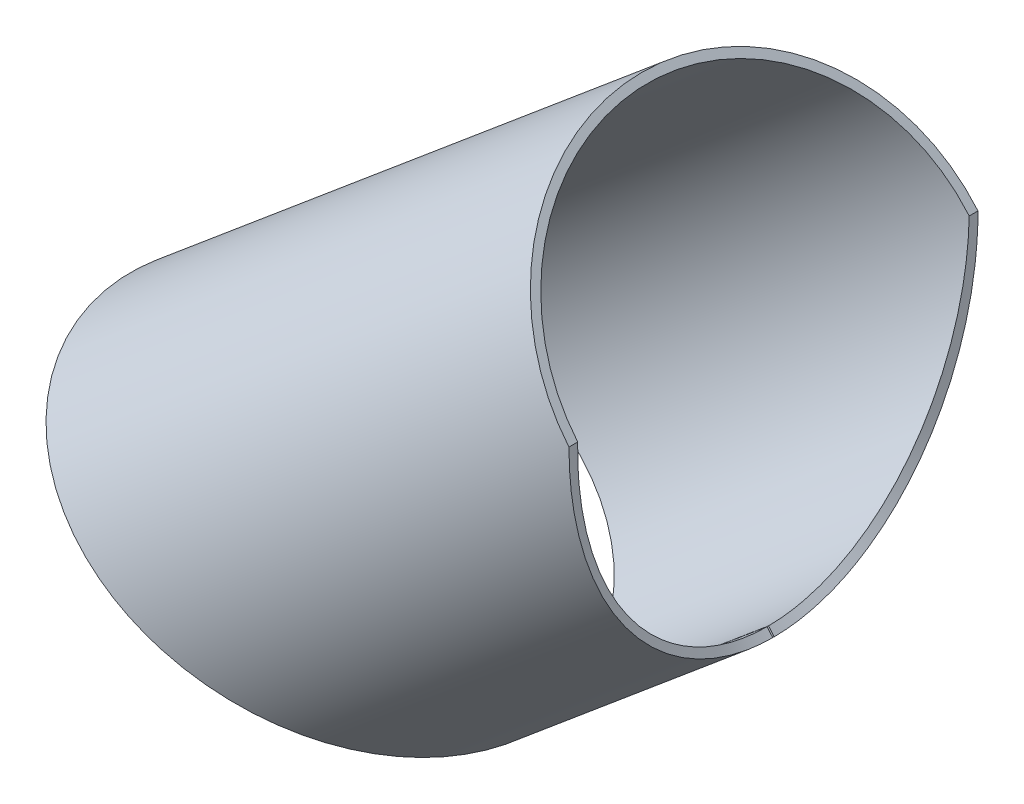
ISO-10303-21;
HEADER;
FILE_DESCRIPTION(('STEP AP214'),'2;1');
FILE_NAME('part.step','',(''),(''),'','','');
FILE_SCHEMA(('AUTOMOTIVE_DESIGN { 1 0 10303 214 1 1 1 1 }'));
ENDSEC;
DATA;
#1=APPLICATION_CONTEXT('core data for automotive mechanical design processes');
#2=APPLICATION_PROTOCOL_DEFINITION('international standard','automotive_design',2000,#1);
#3=PRODUCT_CONTEXT('',#1,'mechanical');
#4=PRODUCT('Part','Part','',(#3));
#5=PRODUCT_RELATED_PRODUCT_CATEGORY('part','',(#4));
#6=PRODUCT_DEFINITION_FORMATION('','',#4);
#7=PRODUCT_DEFINITION_CONTEXT('part definition',#1,'design');
#8=PRODUCT_DEFINITION('design','',#6,#7);
#9=PRODUCT_DEFINITION_SHAPE('','',#8);
#10=(LENGTH_UNIT() NAMED_UNIT(*) SI_UNIT(.MILLI.,.METRE.));
#11=(NAMED_UNIT(*) PLANE_ANGLE_UNIT() SI_UNIT($,.RADIAN.));
#12=(NAMED_UNIT(*) SI_UNIT($,.STERADIAN.) SOLID_ANGLE_UNIT());
#13=UNCERTAINTY_MEASURE_WITH_UNIT(LENGTH_MEASURE(1.E-05),#10,'distance_accuracy_value','');
#14=(GEOMETRIC_REPRESENTATION_CONTEXT(3) GLOBAL_UNCERTAINTY_ASSIGNED_CONTEXT((#13)) GLOBAL_UNIT_ASSIGNED_CONTEXT((#10,
#11,#12)) REPRESENTATION_CONTEXT('',''));
#15=CARTESIAN_POINT('',(0.,0.,0.));
#16=DIRECTION('',(0.,0.,1.));
#17=DIRECTION('',(1.,0.,0.));
#18=AXIS2_PLACEMENT_3D('',#15,#16,#17);
#19=CARTESIAN_POINT('',(3.07902270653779E-13,-1.77861509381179E-12,140.));
#20=CARTESIAN_POINT('',(1.85683479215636E-06,-5.49039366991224,140.));
#21=CARTESIAN_POINT('',(0.000583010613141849,-9.90172563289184,139.817767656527));
#22=CARTESIAN_POINT('',(0.000111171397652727,-14.0668428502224,139.58613576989));
#23=CARTESIAN_POINT('',(2.13054749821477E-05,-14.8324561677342,139.539190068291));
#24=CARTESIAN_POINT('',(-4.0227315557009E-06,-15.8798833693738,139.470757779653));
#25=CARTESIAN_POINT('',(2.64158616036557E-06,-16.2162893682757,139.448025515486));
#26=CARTESIAN_POINT('',(1.13466036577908E-05,-16.893518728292,139.400836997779));
#27=CARTESIAN_POINT('',(1.80352025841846E-05,-17.2300435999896,139.376658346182));
#28=CARTESIAN_POINT('',(5.80948297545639E-05,-18.9022128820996,139.252972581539));
#29=CARTESIAN_POINT('',(0.000108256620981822,-20.2064884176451,139.145094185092));
#30=CARTESIAN_POINT('',(0.00019421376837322,-24.018793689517,138.799491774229));
#31=CARTESIAN_POINT('',(0.000135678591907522,-26.4262665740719,138.539882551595));
#32=CARTESIAN_POINT('',(2.02363358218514E-05,-29.8365540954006,138.124488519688));
#33=CARTESIAN_POINT('',(-5.28540580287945E-06,-30.9350481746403,137.982333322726));
#34=CARTESIAN_POINT('',(1.23016922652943E-05,-33.08781556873,137.68893904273));
#35=CARTESIAN_POINT('',(3.49511032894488E-05,-34.149256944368,137.536644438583));
#36=CARTESIAN_POINT('',(0.000129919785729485,-39.3816478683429,136.7499900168));
#37=CARTESIAN_POINT('',(-3.39672019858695E-05,-43.3272192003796,136.040536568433));
#38=CARTESIAN_POINT('',(4.53106097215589E-05,-50.743029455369,134.527511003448));
#39=CARTESIAN_POINT('',(0.000125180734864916,-54.3042004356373,133.705193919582));
#40=CARTESIAN_POINT('',(7.31803621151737E-06,-61.1326473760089,131.964080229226));
#41=CARTESIAN_POINT('',(2.38468288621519E-05,-64.3915850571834,131.048378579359));
#42=CARTESIAN_POINT('',(8.49270899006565E-05,-70.7238852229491,129.118516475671));
#43=CARTESIAN_POINT('',(2.22634716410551E-05,-73.7851309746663,128.107030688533));
#44=CARTESIAN_POINT('',(-1.61438421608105E-05,-79.6981395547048,126.011282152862));
#45=CARTESIAN_POINT('',(5.5777360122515E-05,-82.565249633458,124.921691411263));
#46=CARTESIAN_POINT('',(5.06891241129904E-05,-88.13723615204,122.667315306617));
#47=CARTESIAN_POINT('',(-4.85760378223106E-05,-90.8353025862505,121.505392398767));
#48=CARTESIAN_POINT('',(0.000158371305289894,-98.7077564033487,117.916566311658));
#49=CARTESIAN_POINT('',(0.000694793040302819,-103.68377957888,115.375016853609));
#50=CARTESIAN_POINT('',(0.000465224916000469,-110.737450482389,111.395048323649));
#51=CARTESIAN_POINT('',(0.000271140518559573,-113.020345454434,110.040411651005));
#52=CARTESIAN_POINT('',(-1.54977345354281E-05,-117.449879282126,107.283967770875));
#53=CARTESIAN_POINT('',(3.05396666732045E-05,-119.593603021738,105.884125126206));
#54=CARTESIAN_POINT('',(0.000242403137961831,-125.846393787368,101.609887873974));
#55=CARTESIAN_POINT('',(-7.21690423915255E-05,-129.775587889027,98.6619580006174));
#56=CARTESIAN_POINT('',(-6.28331457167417E-05,-137.190646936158,92.5879129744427));
#57=CARTESIAN_POINT('',(-0.000107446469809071,-140.673974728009,89.4632478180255));
#58=CARTESIAN_POINT('',(0.000114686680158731,-147.192715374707,83.0809797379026));
#59=CARTESIAN_POINT('',(7.87745460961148E-05,-150.235057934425,79.8169953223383));
#60=CARTESIAN_POINT('',(-1.55030916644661E-05,-155.891229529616,73.1756736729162));
#61=CARTESIAN_POINT('',(0.000163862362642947,-158.506290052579,69.7972483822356));
#62=CARTESIAN_POINT('',(9.49863725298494E-05,-163.330386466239,62.9331393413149));
#63=CARTESIAN_POINT('',(-1.22569471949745E-05,-165.535099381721,59.4536600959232));
#64=CARTESIAN_POINT('',(0.000388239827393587,-169.548715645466,52.3970649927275));
#65=CARTESIAN_POINT('',(0.000590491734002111,-171.355824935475,48.8223358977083));
#66=CARTESIAN_POINT('',(0.00038882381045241,-176.177085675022,37.9998671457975));
#67=CARTESIAN_POINT('',(7.13998823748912E-05,-178.587670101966,30.6660153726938));
#68=CARTESIAN_POINT('',(2.06223540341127E-05,-181.029833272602,19.565155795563));
#69=CARTESIAN_POINT('',(1.91361180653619E-05,-181.647448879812,15.8503616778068));
#70=CARTESIAN_POINT('',(8.49178696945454E-06,-182.281327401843,10.2659410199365));
#71=CARTESIAN_POINT('',(5.25766876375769E-06,-182.443800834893,8.40295371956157));
#72=CARTESIAN_POINT('',(1.72148908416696E-06,-182.614515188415,5.60582829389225));
#73=CARTESIAN_POINT('',(-2.1680595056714E-05,-182.659105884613,4.6785986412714));
#74=CARTESIAN_POINT('',(2.15051033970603E-05,-182.700128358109,3.5003905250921));
#75=CARTESIAN_POINT('',(2.90802351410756E-05,-182.707594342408,3.26365723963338));
#76=CARTESIAN_POINT('',(2.09575639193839E-05,-182.721024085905,2.78801264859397));
#77=CARTESIAN_POINT('',(-5.70349815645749E-05,-182.726892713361,2.55651241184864));
#78=CARTESIAN_POINT('',(0.000160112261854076,-182.742994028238,1.79861246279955));
#79=CARTESIAN_POINT('',(0.000950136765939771,-182.751806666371,1.19731795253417));
#80=CARTESIAN_POINT('',(-1.19045398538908E-12,-182.75585496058,0.499999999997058));
#81=CARTESIAN_POINT('',(2.68133087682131E-13,-1.72393246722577E-12,134.));
#82=CARTESIAN_POINT('',(-0.115861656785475,-5.35229278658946,134.));
#83=CARTESIAN_POINT('',(-0.20838365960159,-9.65268885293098,133.825577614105));
#84=CARTESIAN_POINT('',(-0.296743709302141,-13.7130649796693,133.603872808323));
#85=CARTESIAN_POINT('',(-0.31298873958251,-14.4594253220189,133.558939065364));
#86=CARTESIAN_POINT('',(-0.335117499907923,-15.4805106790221,133.493439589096));
#87=CARTESIAN_POINT('',(-0.342210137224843,-15.808456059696,133.471681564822));
#88=CARTESIAN_POINT('',(-0.356493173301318,-16.4686531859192,133.42651541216));
#89=CARTESIAN_POINT('',(-0.363588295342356,-16.7967144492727,133.403372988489));
#90=CARTESIAN_POINT('',(-0.398836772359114,-18.4268284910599,133.284988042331));
#91=CARTESIAN_POINT('',(-0.426311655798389,-19.6983009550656,133.181733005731));
#92=CARTESIAN_POINT('',(-0.506678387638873,-23.4147264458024,132.850942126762));
#93=CARTESIAN_POINT('',(-0.557540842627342,-25.7616535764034,132.602459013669));
#94=CARTESIAN_POINT('',(-0.629621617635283,-29.0861761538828,132.20486758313));
#95=CARTESIAN_POINT('',(-0.652828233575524,-30.1570440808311,132.068804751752));
#96=CARTESIAN_POINT('',(-0.698240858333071,-32.2556698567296,131.787984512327));
#97=CARTESIAN_POINT('',(-0.720618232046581,-33.2904159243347,131.642216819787));
#98=CARTESIAN_POINT('',(-0.830944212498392,-38.3912122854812,130.889276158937));
#99=CARTESIAN_POINT('',(-0.914368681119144,-42.2375575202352,130.210227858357));
#100=CARTESIAN_POINT('',(-1.07078682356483,-49.4668614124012,128.762046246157));
#101=CARTESIAN_POINT('',(-1.14585984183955,-52.9384686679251,127.974971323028));
#102=CARTESIAN_POINT('',(-1.2900764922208,-59.5951853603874,126.30847679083));
#103=CARTESIAN_POINT('',(-1.35883369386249,-62.7721617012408,125.432019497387));
#104=CARTESIAN_POINT('',(-1.49240437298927,-68.9452057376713,123.584865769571));
#105=CARTESIAN_POINT('',(-1.55706746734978,-71.9294636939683,122.61672937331));
#106=CARTESIAN_POINT('',(-1.68188755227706,-77.693763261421,120.610798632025));
#107=CARTESIAN_POINT('',(-1.74232159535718,-80.4887651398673,119.567904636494));
#108=CARTESIAN_POINT('',(-1.85991235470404,-85.9206185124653,117.410144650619));
#109=CARTESIAN_POINT('',(-1.91694722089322,-88.5508317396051,116.29801843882));
#110=CARTESIAN_POINT('',(-2.08287651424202,-96.2252920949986,112.862999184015));
#111=CARTESIAN_POINT('',(-2.18735872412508,-101.07615893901,110.430373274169));
#112=CARTESIAN_POINT('',(-2.33643800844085,-107.952437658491,106.620974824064));
#113=CARTESIAN_POINT('',(-2.38480464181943,-110.177922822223,105.324394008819));
#114=CARTESIAN_POINT('',(-2.47856275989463,-114.496061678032,102.686083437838));
#115=CARTESIAN_POINT('',(-2.52375658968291,-116.585870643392,101.346234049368));
#116=CARTESIAN_POINT('',(-2.65550126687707,-122.681401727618,97.2551783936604));
#117=CARTESIAN_POINT('',(-2.73872814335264,-126.511784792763,94.4335883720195));
#118=CARTESIAN_POINT('',(-2.89519913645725,-133.740357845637,88.6198595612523));
#119=CARTESIAN_POINT('',(-2.96875170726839,-137.136082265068,85.6291086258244));
#120=CARTESIAN_POINT('',(-3.10609864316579,-143.490874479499,79.5203663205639));
#121=CARTESIAN_POINT('',(-3.17033654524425,-146.456704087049,76.396266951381));
#122=CARTESIAN_POINT('',(-3.28979147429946,-151.970627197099,70.0395733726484));
#123=CARTESIAN_POINT('',(-3.34480096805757,-154.519916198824,66.8059377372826));
#124=CARTESIAN_POINT('',(-3.44667164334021,-159.222689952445,60.2360047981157));
#125=CARTESIAN_POINT('',(-3.49330309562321,-161.371957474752,56.9056460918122));
#126=CARTESIAN_POINT('',(-3.57760912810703,-165.284624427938,50.1514764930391));
#127=CARTESIAN_POINT('',(-3.6155459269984,-167.04628136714,46.7299500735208));
#128=CARTESIAN_POINT('',(-3.71748720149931,-171.746293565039,36.3713014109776));
#129=CARTESIAN_POINT('',(-3.76866962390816,-174.096259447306,29.351757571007));
#130=CARTESIAN_POINT('',(-3.82025652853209,-176.477004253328,18.7266491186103));
#131=CARTESIAN_POINT('',(-3.8332915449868,-177.079087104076,15.1710604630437));
#132=CARTESIAN_POINT('',(-3.84667875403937,-177.697024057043,9.82597211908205));
#133=CARTESIAN_POINT('',(-3.85011061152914,-177.855411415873,8.04282713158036));
#134=CARTESIAN_POINT('',(-3.85371667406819,-178.021832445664,5.36557850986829));
#135=CARTESIAN_POINT('',(-3.8546806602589,-178.065302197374,4.47808727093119));
#136=CARTESIAN_POINT('',(-3.85550393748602,-178.105292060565,3.35037378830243));
#137=CARTESIAN_POINT('',(-3.85565405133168,-178.112570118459,3.12378621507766));
#138=CARTESIAN_POINT('',(-3.85594543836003,-178.12566228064,2.66852639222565));
#139=CARTESIAN_POINT('',(-3.85614589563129,-178.13138496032,2.44694759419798));
#140=CARTESIAN_POINT('',(-3.85627237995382,-178.147076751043,1.72152907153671));
#141=CARTESIAN_POINT('',(-3.85568231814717,-178.155651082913,1.14600432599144));
#142=CARTESIAN_POINT('',(-3.85670106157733,-178.159617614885,0.478571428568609));
#143=B_SPLINE_SURFACE_WITH_KNOTS('',1,3,((#19,#20,#21,#22,#23,#24,#25,#26,#27,#28,#29,#30,#31,
#32,#33,#34,#35,#36,#37,#38,#39,#40,#41,#42,#43,#44,#45,#46,#47,#48,#49,#50,#51,#52,#53,#54,#55,
#56,#57,#58,#59,#60,#61,#62,#63,#64,#65,#66,#67,#68,#69,#70,#71,#72,#73,#74,#75,#76,#77,#78,#79,
#80),(#81,#82,#83,#84,#85,#86,#87,#88,#89,#90,#91,#92,#93,#94,#95,#96,#97,#98,#99,#100,#101,
#102,#103,#104,#105,#106,#107,#108,#109,#110,#111,#112,#113,#114,#115,#116,#117,#118,#119,#120,
#121,#122,#123,#124,#125,#126,#127,#128,#129,#130,#131,#132,#133,#134,#135,#136,#137,#138,#139,
#140,#141,#142)),.UNSPECIFIED.,.F.,.F.,.F.,(2,2),(4,2,2,2,2,2,2,2,2,2,2,2,2,2,2,2,2,2,2,2,2,2,2,
2,2,2,2,2,2,2,4),(0.,1.),(0.,0.015625,0.01953125,0.021484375,0.0234375,0.03125,0.046875,
0.0546875,0.0625,0.09375,0.125,0.15625,0.1875,0.21875,0.25,0.3125,0.34375,0.375,0.4375,0.5,
0.5625,0.625,0.6875,0.75,0.875,0.9375,0.96875,0.984375,0.98828125,0.9921875,1.),.UNSPECIFIED.);
#144=CARTESIAN_POINT('',(-1.19045398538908E-12,-182.75585496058,0.499999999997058));
#145=CARTESIAN_POINT('',(-3.85670106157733,-178.159617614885,0.478571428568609));
#146=B_SPLINE_CURVE_WITH_KNOTS('',1,(#144,#145),.UNSPECIFIED.,.F.,.F.,(2,2),(0.,1.),.UNSPECIFIED.);
#147=CARTESIAN_POINT('',(-3.85670106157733,-178.159617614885,0.478571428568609));
#148=VERTEX_POINT('',#147);
#149=CARTESIAN_POINT('',(-1.19348975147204E-12,-182.75585496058,0.499999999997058));
#150=VERTEX_POINT('',#149);
#151=EDGE_CURVE('E13',#148,#150,#146,.F.);
#152=CARTESIAN_POINT('',(-3.85670106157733,-178.159617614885,0.478571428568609));
#153=CARTESIAN_POINT('',(-3.85568231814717,-178.155651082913,1.14600432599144));
#154=CARTESIAN_POINT('',(-3.85627237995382,-178.147076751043,1.72152907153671));
#155=CARTESIAN_POINT('',(-3.85614589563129,-178.13138496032,2.44694759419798));
#156=CARTESIAN_POINT('',(-3.85594543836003,-178.12566228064,2.66852639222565));
#157=CARTESIAN_POINT('',(-3.85565405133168,-178.112570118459,3.12378621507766));
#158=CARTESIAN_POINT('',(-3.85550393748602,-178.105292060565,3.35037378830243));
#159=CARTESIAN_POINT('',(-3.8546806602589,-178.065302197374,4.47808727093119));
#160=CARTESIAN_POINT('',(-3.85371667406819,-178.021832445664,5.36557850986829));
#161=CARTESIAN_POINT('',(-3.85011061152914,-177.855411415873,8.04282713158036));
#162=CARTESIAN_POINT('',(-3.84667875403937,-177.697024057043,9.82597211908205));
#163=CARTESIAN_POINT('',(-3.8332915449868,-177.079087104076,15.1710604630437));
#164=CARTESIAN_POINT('',(-3.82025652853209,-176.477004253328,18.7266491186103));
#165=CARTESIAN_POINT('',(-3.76866962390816,-174.096259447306,29.351757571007));
#166=CARTESIAN_POINT('',(-3.71748720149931,-171.746293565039,36.3713014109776));
#167=CARTESIAN_POINT('',(-3.6155459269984,-167.04628136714,46.7299500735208));
#168=CARTESIAN_POINT('',(-3.57760912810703,-165.284624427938,50.1514764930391));
#169=CARTESIAN_POINT('',(-3.49330309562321,-161.371957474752,56.9056460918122));
#170=CARTESIAN_POINT('',(-3.44667164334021,-159.222689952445,60.2360047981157));
#171=CARTESIAN_POINT('',(-3.34480096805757,-154.519916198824,66.8059377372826));
#172=CARTESIAN_POINT('',(-3.28979147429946,-151.970627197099,70.0395733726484));
#173=CARTESIAN_POINT('',(-3.17033654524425,-146.456704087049,76.396266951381));
#174=CARTESIAN_POINT('',(-3.10609864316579,-143.490874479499,79.5203663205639));
#175=CARTESIAN_POINT('',(-2.96875170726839,-137.136082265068,85.6291086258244));
#176=CARTESIAN_POINT('',(-2.89519913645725,-133.740357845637,88.6198595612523));
#177=CARTESIAN_POINT('',(-2.73872814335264,-126.511784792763,94.4335883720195));
#178=CARTESIAN_POINT('',(-2.65550126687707,-122.681401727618,97.2551783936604));
#179=CARTESIAN_POINT('',(-2.52375658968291,-116.585870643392,101.346234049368));
#180=CARTESIAN_POINT('',(-2.47856275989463,-114.496061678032,102.686083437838));
#181=CARTESIAN_POINT('',(-2.38480464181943,-110.177922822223,105.324394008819));
#182=CARTESIAN_POINT('',(-2.33643800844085,-107.952437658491,106.620974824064));
#183=CARTESIAN_POINT('',(-2.18735872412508,-101.07615893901,110.430373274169));
#184=CARTESIAN_POINT('',(-2.08287651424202,-96.2252920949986,112.862999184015));
#185=CARTESIAN_POINT('',(-1.91694722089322,-88.5508317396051,116.29801843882));
#186=CARTESIAN_POINT('',(-1.85991235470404,-85.9206185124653,117.410144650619));
#187=CARTESIAN_POINT('',(-1.74232159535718,-80.4887651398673,119.567904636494));
#188=CARTESIAN_POINT('',(-1.68188755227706,-77.693763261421,120.610798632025));
#189=CARTESIAN_POINT('',(-1.55706746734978,-71.9294636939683,122.61672937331));
#190=CARTESIAN_POINT('',(-1.49240437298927,-68.9452057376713,123.584865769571));
#191=CARTESIAN_POINT('',(-1.35883369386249,-62.7721617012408,125.432019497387));
#192=CARTESIAN_POINT('',(-1.2900764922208,-59.5951853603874,126.30847679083));
#193=CARTESIAN_POINT('',(-1.14585984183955,-52.9384686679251,127.974971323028));
#194=CARTESIAN_POINT('',(-1.07078682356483,-49.4668614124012,128.762046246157));
#195=CARTESIAN_POINT('',(-0.914368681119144,-42.2375575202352,130.210227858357));
#196=CARTESIAN_POINT('',(-0.830944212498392,-38.3912122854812,130.889276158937));
#197=CARTESIAN_POINT('',(-0.720618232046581,-33.2904159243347,131.642216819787));
#198=CARTESIAN_POINT('',(-0.698240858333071,-32.2556698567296,131.787984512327));
#199=CARTESIAN_POINT('',(-0.652828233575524,-30.1570440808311,132.068804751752));
#200=CARTESIAN_POINT('',(-0.629621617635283,-29.0861761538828,132.20486758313));
#201=CARTESIAN_POINT('',(-0.557540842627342,-25.7616535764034,132.602459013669));
#202=CARTESIAN_POINT('',(-0.506678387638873,-23.4147264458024,132.850942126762));
#203=CARTESIAN_POINT('',(-0.426311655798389,-19.6983009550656,133.181733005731));
#204=CARTESIAN_POINT('',(-0.398836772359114,-18.4268284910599,133.284988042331));
#205=CARTESIAN_POINT('',(-0.363588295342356,-16.7967144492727,133.403372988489));
#206=CARTESIAN_POINT('',(-0.356493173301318,-16.4686531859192,133.42651541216));
#207=CARTESIAN_POINT('',(-0.342210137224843,-15.808456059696,133.471681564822));
#208=CARTESIAN_POINT('',(-0.335117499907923,-15.4805106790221,133.493439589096));
#209=CARTESIAN_POINT('',(-0.31298873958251,-14.4594253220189,133.558939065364));
#210=CARTESIAN_POINT('',(-0.296743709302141,-13.7130649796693,133.603872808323));
#211=CARTESIAN_POINT('',(-0.20838365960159,-9.65268885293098,133.825577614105));
#212=CARTESIAN_POINT('',(-0.115861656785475,-5.35229278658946,134.));
#213=CARTESIAN_POINT('',(2.68133087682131E-13,-1.72393246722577E-12,134.));
#214=B_SPLINE_CURVE_WITH_KNOTS('',3,(#152,#153,#154,#155,#156,#157,#158,#159,#160,#161,#162,
#163,#164,#165,#166,#167,#168,#169,#170,#171,#172,#173,#174,#175,#176,#177,#178,#179,#180,#181,
#182,#183,#184,#185,#186,#187,#188,#189,#190,#191,#192,#193,#194,#195,#196,#197,#198,#199,#200,
#201,#202,#203,#204,#205,#206,#207,#208,#209,#210,#211,#212,#213),.UNSPECIFIED.,.F.,.F.,(4,2,2,
2,2,2,2,2,2,2,2,2,2,2,2,2,2,2,2,2,2,2,2,2,2,2,2,2,2,2,4),(0.,0.0078125,0.01171875,0.015625,
0.03125,0.0625,0.125,0.25,0.3125,0.375,0.4375,0.5,0.5625,0.625,0.65625,0.6875,0.75,0.78125,
0.8125,0.84375,0.875,0.90625,0.9375,0.9453125,0.953125,0.96875,0.9765625,0.978515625,0.98046875,
0.984375,1.),.UNSPECIFIED.);
#215=CARTESIAN_POINT('',(1.8352943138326E-13,-1.83331986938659E-12,134.));
#216=VERTEX_POINT('',#215);
#217=EDGE_CURVE('E198',#216,#148,#214,.F.);
#218=CARTESIAN_POINT('',(2.68133087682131E-13,-1.72393246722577E-12,134.));
#219=CARTESIAN_POINT('',(3.07902270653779E-13,-1.77861509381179E-12,140.));
#220=B_SPLINE_CURVE_WITH_KNOTS('',1,(#218,#219),.UNSPECIFIED.,.F.,.F.,(2,2),(0.,1.),.UNSPECIFIED.);
#221=CARTESIAN_POINT('',(3.09965934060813E-13,-1.77626773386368E-12,140.));
#222=VERTEX_POINT('',#221);
#223=EDGE_CURVE('E52',#216,#222,#220,.T.);
#224=CARTESIAN_POINT('',(3.07902270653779E-13,-1.77861509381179E-12,140.));
#225=CARTESIAN_POINT('',(1.85683479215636E-06,-5.49039366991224,140.));
#226=CARTESIAN_POINT('',(0.000583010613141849,-9.90172563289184,139.817767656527));
#227=CARTESIAN_POINT('',(0.000111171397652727,-14.0668428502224,139.58613576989));
#228=CARTESIAN_POINT('',(2.13054749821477E-05,-14.8324561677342,139.539190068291));
#229=CARTESIAN_POINT('',(-4.0227315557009E-06,-15.8798833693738,139.470757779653));
#230=CARTESIAN_POINT('',(2.64158616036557E-06,-16.2162893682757,139.448025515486));
#231=CARTESIAN_POINT('',(1.13466036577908E-05,-16.893518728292,139.400836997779));
#232=CARTESIAN_POINT('',(1.80352025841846E-05,-17.2300435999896,139.376658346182));
#233=CARTESIAN_POINT('',(5.80948297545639E-05,-18.9022128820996,139.252972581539));
#234=CARTESIAN_POINT('',(0.000108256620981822,-20.2064884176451,139.145094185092));
#235=CARTESIAN_POINT('',(0.00019421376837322,-24.018793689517,138.799491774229));
#236=CARTESIAN_POINT('',(0.000135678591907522,-26.4262665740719,138.539882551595));
#237=CARTESIAN_POINT('',(2.02363358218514E-05,-29.8365540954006,138.124488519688));
#238=CARTESIAN_POINT('',(-5.28540580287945E-06,-30.9350481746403,137.982333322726));
#239=CARTESIAN_POINT('',(1.23016922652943E-05,-33.08781556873,137.68893904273));
#240=CARTESIAN_POINT('',(3.49511032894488E-05,-34.149256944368,137.536644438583));
#241=CARTESIAN_POINT('',(0.000129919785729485,-39.3816478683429,136.7499900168));
#242=CARTESIAN_POINT('',(-3.39672019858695E-05,-43.3272192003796,136.040536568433));
#243=CARTESIAN_POINT('',(4.53106097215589E-05,-50.743029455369,134.527511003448));
#244=CARTESIAN_POINT('',(0.000125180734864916,-54.3042004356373,133.705193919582));
#245=CARTESIAN_POINT('',(7.31803621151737E-06,-61.1326473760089,131.964080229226));
#246=CARTESIAN_POINT('',(2.38468288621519E-05,-64.3915850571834,131.048378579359));
#247=CARTESIAN_POINT('',(8.49270899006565E-05,-70.7238852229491,129.118516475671));
#248=CARTESIAN_POINT('',(2.22634716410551E-05,-73.7851309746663,128.107030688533));
#249=CARTESIAN_POINT('',(-1.61438421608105E-05,-79.6981395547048,126.011282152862));
#250=CARTESIAN_POINT('',(5.5777360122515E-05,-82.565249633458,124.921691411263));
#251=CARTESIAN_POINT('',(5.06891241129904E-05,-88.13723615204,122.667315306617));
#252=CARTESIAN_POINT('',(-4.85760378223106E-05,-90.8353025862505,121.505392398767));
#253=CARTESIAN_POINT('',(0.000158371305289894,-98.7077564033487,117.916566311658));
#254=CARTESIAN_POINT('',(0.000694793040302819,-103.68377957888,115.375016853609));
#255=CARTESIAN_POINT('',(0.000465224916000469,-110.737450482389,111.395048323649));
#256=CARTESIAN_POINT('',(0.000271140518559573,-113.020345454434,110.040411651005));
#257=CARTESIAN_POINT('',(-1.54977345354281E-05,-117.449879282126,107.283967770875));
#258=CARTESIAN_POINT('',(3.05396666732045E-05,-119.593603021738,105.884125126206));
#259=CARTESIAN_POINT('',(0.000242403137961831,-125.846393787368,101.609887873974));
#260=CARTESIAN_POINT('',(-7.21690423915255E-05,-129.775587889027,98.6619580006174));
#261=CARTESIAN_POINT('',(-6.28331457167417E-05,-137.190646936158,92.5879129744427));
#262=CARTESIAN_POINT('',(-0.000107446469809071,-140.673974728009,89.4632478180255));
#263=CARTESIAN_POINT('',(0.000114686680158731,-147.192715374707,83.0809797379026));
#264=CARTESIAN_POINT('',(7.87745460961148E-05,-150.235057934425,79.8169953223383));
#265=CARTESIAN_POINT('',(-1.55030916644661E-05,-155.891229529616,73.1756736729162));
#266=CARTESIAN_POINT('',(0.000163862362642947,-158.506290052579,69.7972483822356));
#267=CARTESIAN_POINT('',(9.49863725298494E-05,-163.330386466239,62.9331393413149));
#268=CARTESIAN_POINT('',(-1.22569471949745E-05,-165.535099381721,59.4536600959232));
#269=CARTESIAN_POINT('',(0.000388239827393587,-169.548715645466,52.3970649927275));
#270=CARTESIAN_POINT('',(0.000590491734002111,-171.355824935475,48.8223358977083));
#271=CARTESIAN_POINT('',(0.00038882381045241,-176.177085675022,37.9998671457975));
#272=CARTESIAN_POINT('',(7.13998823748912E-05,-178.587670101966,30.6660153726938));
#273=CARTESIAN_POINT('',(2.06223540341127E-05,-181.029833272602,19.565155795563));
#274=CARTESIAN_POINT('',(1.91361180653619E-05,-181.647448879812,15.8503616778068));
#275=CARTESIAN_POINT('',(8.49178696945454E-06,-182.281327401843,10.2659410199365));
#276=CARTESIAN_POINT('',(5.25766876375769E-06,-182.443800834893,8.40295371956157));
#277=CARTESIAN_POINT('',(1.72148908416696E-06,-182.614515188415,5.60582829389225));
#278=CARTESIAN_POINT('',(-2.1680595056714E-05,-182.659105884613,4.6785986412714));
#279=CARTESIAN_POINT('',(2.15051033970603E-05,-182.700128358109,3.5003905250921));
#280=CARTESIAN_POINT('',(2.90802351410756E-05,-182.707594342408,3.26365723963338));
#281=CARTESIAN_POINT('',(2.09575639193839E-05,-182.721024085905,2.78801264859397));
#282=CARTESIAN_POINT('',(-5.70349815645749E-05,-182.726892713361,2.55651241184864));
#283=CARTESIAN_POINT('',(0.000160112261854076,-182.742994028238,1.79861246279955));
#284=CARTESIAN_POINT('',(0.000950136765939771,-182.751806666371,1.19731795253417));
#285=CARTESIAN_POINT('',(-1.19045398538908E-12,-182.75585496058,0.499999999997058));
#286=B_SPLINE_CURVE_WITH_KNOTS('',3,(#224,#225,#226,#227,#228,#229,#230,#231,#232,#233,#234,
#235,#236,#237,#238,#239,#240,#241,#242,#243,#244,#245,#246,#247,#248,#249,#250,#251,#252,#253,
#254,#255,#256,#257,#258,#259,#260,#261,#262,#263,#264,#265,#266,#267,#268,#269,#270,#271,#272,
#273,#274,#275,#276,#277,#278,#279,#280,#281,#282,#283,#284,#285),.UNSPECIFIED.,.F.,.F.,(4,2,2,
2,2,2,2,2,2,2,2,2,2,2,2,2,2,2,2,2,2,2,2,2,2,2,2,2,2,2,4),(0.,0.015625,0.01953125,0.021484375,
0.0234375,0.03125,0.046875,0.0546875,0.0625,0.09375,0.125,0.15625,0.1875,0.21875,0.25,0.3125,
0.34375,0.375,0.4375,0.5,0.5625,0.625,0.6875,0.75,0.875,0.9375,0.96875,0.984375,0.98828125,
0.9921875,1.),.UNSPECIFIED.);
#287=EDGE_CURVE('E126',#222,#150,#286,.T.);
#288=ORIENTED_EDGE('',*,*,#151,.F.);
#289=ORIENTED_EDGE('',*,*,#217,.F.);
#290=ORIENTED_EDGE('',*,*,#223,.T.);
#291=ORIENTED_EDGE('',*,*,#287,.T.);
#292=EDGE_LOOP('',(#288,#289,#290,#291));
#293=FACE_BOUND('',#292,.T.);
#294=ADVANCED_FACE('F40',(#293),#143,.F.);
#295=CARTESIAN_POINT('',(-5.55111512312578E-13,-4.44089209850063E-13,0.));
#296=DIRECTION('',(-0.766044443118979,-0.642787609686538,0.));
#297=DIRECTION('',(0.642787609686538,-0.766044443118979,0.));
#298=AXIS2_PLACEMENT_3D('',#295,#296,#297);
#299=PLANE('',#298);
#300=ORIENTED_EDGE('',*,*,#223,.F.);
#301=CARTESIAN_POINT('',(-5.55111512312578E-13,-4.44089209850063E-13,0.));
#302=DIRECTION('',(0.766044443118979,0.642787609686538,0.));
#303=DIRECTION('',(-0.642787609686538,0.766044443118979,0.));
#304=AXIS2_PLACEMENT_3D('',#301,#302,#303);
#305=CIRCLE('',#304,134.);
#306=CARTESIAN_POINT('',(-5.4365234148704E-13,-4.02340700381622E-13,-134.));
#307=VERTEX_POINT('',#306);
#308=EDGE_CURVE('E109',#307,#216,#305,.T.);
#309=ORIENTED_EDGE('',*,*,#308,.F.);
#310=CARTESIAN_POINT('',(-5.4365234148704E-13,-4.02340700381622E-13,-140.));
#311=CARTESIAN_POINT('',(-5.4365234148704E-13,-4.02340700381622E-13,-134.));
#312=B_SPLINE_CURVE_WITH_KNOTS('',1,(#310,#311),.UNSPECIFIED.,.F.,.F.,(2,2),(0.,1.),.UNSPECIFIED.);
#313=CARTESIAN_POINT('',(-5.43139244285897E-13,-4.00471364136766E-13,-140.));
#314=VERTEX_POINT('',#313);
#315=EDGE_CURVE('E104',#307,#314,#312,.F.);
#316=ORIENTED_EDGE('',*,*,#315,.T.);
#317=CARTESIAN_POINT('',(-5.55111512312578E-13,-4.44089209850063E-13,0.));
#318=DIRECTION('',(-0.766044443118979,-0.642787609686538,0.));
#319=DIRECTION('',(0.642787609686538,-0.766044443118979,0.));
#320=AXIS2_PLACEMENT_3D('',#317,#318,#319);
#321=CIRCLE('',#320,140.);
#322=EDGE_CURVE('E108',#314,#222,#321,.F.);
#323=ORIENTED_EDGE('',*,*,#322,.T.);
#324=EDGE_LOOP('',(#300,#309,#316,#323));
#325=FACE_BOUND('',#324,.T.);
#326=ADVANCED_FACE('F107',(#325),#299,.F.);
#327=CARTESIAN_POINT('',(-2.1987620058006E-13,-182.755854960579,-0.500000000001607));
#328=CARTESIAN_POINT('',(0.0011026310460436,-182.7514907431,-1.23763484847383));
#329=CARTESIAN_POINT('',(8.95036163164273E-05,-182.742033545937,-1.85762869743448));
#330=CARTESIAN_POINT('',(-8.38345485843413E-05,-182.725594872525,-2.61116372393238));
#331=CARTESIAN_POINT('',(5.76850550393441E-06,-182.719620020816,-2.84195743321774));
#332=CARTESIAN_POINT('',(1.96295498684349E-05,-182.70596263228,-3.31706584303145));
#333=CARTESIAN_POINT('',(1.37923132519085E-05,-182.69838801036,-3.553464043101));
#334=CARTESIAN_POINT('',(-2.3168696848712E-05,-182.656852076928,-4.72966197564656));
#335=CARTESIAN_POINT('',(-2.77573932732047E-06,-182.61191524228,-5.65517720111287));
#336=CARTESIAN_POINT('',(6.82023368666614E-06,-182.44016931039,-8.44853008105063));
#337=CARTESIAN_POINT('',(7.58722337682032E-06,-182.277079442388,-10.3097773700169));
#338=CARTESIAN_POINT('',(2.05088020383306E-05,-181.641642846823,-15.8884739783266));
#339=CARTESIAN_POINT('',(1.91362018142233E-05,-181.023340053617,-19.5997280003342));
#340=CARTESIAN_POINT('',(7.44519488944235E-05,-178.5801569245,-30.6899894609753));
#341=CARTESIAN_POINT('',(0.000383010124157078,-176.170240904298,-38.0171382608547));
#342=CARTESIAN_POINT('',(0.000582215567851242,-171.352136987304,-48.8296807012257));
#343=CARTESIAN_POINT('',(0.000381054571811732,-169.546437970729,-52.4011475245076));
#344=CARTESIAN_POINT('',(-1.43527880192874E-05,-165.536357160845,-59.4513842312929));
#345=CARTESIAN_POINT('',(9.6903388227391E-05,-163.333758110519,-62.9277783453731));
#346=CARTESIAN_POINT('',(0.000164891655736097,-158.51473737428,-69.7857873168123));
#347=CARTESIAN_POINT('',(-1.58060701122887E-05,-155.902630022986,-73.1612121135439));
#348=CARTESIAN_POINT('',(7.91324978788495E-05,-150.253207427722,-79.7967539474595));
#349=CARTESIAN_POINT('',(0.000115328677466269,-147.214626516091,-83.0580026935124));
#350=CARTESIAN_POINT('',(-0.000106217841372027,-140.704126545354,-89.4352396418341));
#351=CARTESIAN_POINT('',(-2.08122636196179E-05,-137.224772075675,-92.5580746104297));
#352=CARTESIAN_POINT('',(-3.81109344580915E-05,-129.817162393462,-98.6297158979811));
#353=CARTESIAN_POINT('',(0.000220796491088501,-125.891968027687,-101.576791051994));
#354=CARTESIAN_POINT('',(3.67927814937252E-05,-119.64019293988,-105.853237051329));
#355=CARTESIAN_POINT('',(-1.59921041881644E-05,-117.496292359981,-107.254153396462));
#356=CARTESIAN_POINT('',(0.000270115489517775,-113.066689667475,-110.012482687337));
#357=CARTESIAN_POINT('',(0.000465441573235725,-110.783703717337,-111.368070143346));
#358=CARTESIAN_POINT('',(0.00069902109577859,-103.729585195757,-115.350901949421));
#359=CARTESIAN_POINT('',(0.000165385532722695,-98.75303037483,-117.894375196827));
#360=CARTESIAN_POINT('',(-4.990337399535E-05,-90.8794141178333,-121.486049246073));
#361=CARTESIAN_POINT('',(4.96555922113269E-05,-88.1811315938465,-122.648816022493));
#362=CARTESIAN_POINT('',(5.67704634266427E-05,-82.6082580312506,-124.905018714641));
#363=CARTESIAN_POINT('',(-1.49914032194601E-05,-79.7404228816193,-125.995597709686));
#364=CARTESIAN_POINT('',(1.99150396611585E-05,-73.8263828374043,-128.093098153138));
#365=CARTESIAN_POINT('',(8.48115803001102E-05,-70.7644348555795,-129.105498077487));
#366=CARTESIAN_POINT('',(2.53851859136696E-05,-64.4303443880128,-131.037218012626));
#367=CARTESIAN_POINT('',(5.75891716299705E-06,-61.1705001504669,-131.953810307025));
#368=CARTESIAN_POINT('',(0.000126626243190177,-54.339746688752,-133.696741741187));
#369=CARTESIAN_POINT('',(4.99243377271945E-05,-50.7770128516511,-134.520022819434));
#370=CARTESIAN_POINT('',(-3.74301667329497E-05,-43.3572365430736,-136.034962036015));
#371=CARTESIAN_POINT('',(0.000129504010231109,-39.4100142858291,-136.745251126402));
#372=CARTESIAN_POINT('',(3.5546782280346E-05,-34.1739729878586,-137.533045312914));
#373=CARTESIAN_POINT('',(1.29023516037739E-05,-33.1117550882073,-137.685565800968));
#374=CARTESIAN_POINT('',(-5.31481347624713E-06,-30.9573414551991,-137.97940326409));
#375=CARTESIAN_POINT('',(1.9378019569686E-05,-29.8583445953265,-138.121728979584));
#376=CARTESIAN_POINT('',(0.000134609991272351,-26.4459441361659,-138.53769351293));
#377=CARTESIAN_POINT('',(0.000194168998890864,-24.036762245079,-138.797688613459));
#378=CARTESIAN_POINT('',(0.000108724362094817,-20.2214395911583,-139.143825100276));
#379=CARTESIAN_POINT('',(5.85872830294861E-05,-18.916082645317,-139.251873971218));
#380=CARTESIAN_POINT('',(1.83177246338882E-05,-17.2424670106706,-139.375757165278));
#381=CARTESIAN_POINT('',(1.15758186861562E-05,-16.9056481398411,-139.399974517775));
#382=CARTESIAN_POINT('',(2.74309535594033E-06,-16.2278213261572,-139.447238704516));
#383=CARTESIAN_POINT('',(-3.90129661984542E-06,-15.8910027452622,-139.470014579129));
#384=CARTESIAN_POINT('',(2.02478494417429E-05,-14.8435696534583,-139.538496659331));
#385=CARTESIAN_POINT('',(0.000109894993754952,-14.0778054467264,-139.585488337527));
#386=CARTESIAN_POINT('',(0.000582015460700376,-9.91119722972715,-139.817390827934));
#387=CARTESIAN_POINT('',(1.9521027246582E-06,-5.49631328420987,-140.));
#388=CARTESIAN_POINT('',(-5.4365234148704E-13,-4.02340700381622E-13,-140.));
#389=CARTESIAN_POINT('',(-3.85670106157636,-178.159617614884,-0.47857142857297));
#390=CARTESIAN_POINT('',(-3.85552585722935,-178.155339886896,-1.18459335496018));
#391=CARTESIAN_POINT('',(-3.85632146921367,-178.146141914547,-1.778016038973));
#392=CARTESIAN_POINT('',(-3.85614483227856,-178.130120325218,-2.49925670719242));
#393=CARTESIAN_POINT('',(-3.85593072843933,-178.124293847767,-2.72015925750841));
#394=CARTESIAN_POINT('',(-3.85562890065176,-178.110979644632,-3.1749058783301));
#395=CARTESIAN_POINT('',(-3.85547478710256,-178.103595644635,-3.4011727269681));
#396=CARTESIAN_POINT('',(-3.85463455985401,-178.063105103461,-4.52696217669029));
#397=CARTESIAN_POINT('',(-3.85366622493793,-178.019297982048,-5.41281246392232));
#398=CARTESIAN_POINT('',(-3.85003244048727,-177.851871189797,-8.08645022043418));
#399=CARTESIAN_POINT('',(-3.84658999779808,-177.692882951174,-9.86792976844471));
#400=CARTESIAN_POINT('',(-3.83316767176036,-177.073427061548,-15.2075393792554));
#401=CARTESIAN_POINT('',(-3.82012096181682,-176.470674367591,-18.7597396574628));
#402=CARTESIAN_POINT('',(-3.76850807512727,-174.088935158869,-29.3747041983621));
#403=CARTESIAN_POINT('',(-3.7173484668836,-171.739621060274,-36.3878323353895));
#404=CARTESIAN_POINT('',(-3.61547622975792,-167.042686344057,-46.7369800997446));
#405=CARTESIAN_POINT('',(-3.57756812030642,-165.282404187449,-50.1553840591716));
#406=CARTESIAN_POINT('',(-3.493331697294,-161.373183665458,-56.9034677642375));
#407=CARTESIAN_POINT('',(-3.44674091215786,-159.225976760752,-60.2308735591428));
#408=CARTESIAN_POINT('',(-3.34497822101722,-154.52815105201,-66.7949678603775));
#409=CARTESIAN_POINT('',(-3.29003235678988,-151.981740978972,-70.0257315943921));
#410=CARTESIAN_POINT('',(-3.17071920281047,-146.474397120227,-76.376893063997));
#411=CARTESIAN_POINT('',(-3.10656040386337,-143.51223455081,-79.4983740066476));
#412=CARTESIAN_POINT('',(-2.96938679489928,-137.165475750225,-85.6023008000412));
#413=CARTESIAN_POINT('',(-2.89587800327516,-133.773623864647,-88.5912999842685));
#414=CARTESIAN_POINT('',(-2.73957203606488,-126.552312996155,-94.4027280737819));
#415=CARTESIAN_POINT('',(-2.65648424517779,-122.725830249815,-97.2235000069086));
#416=CARTESIAN_POINT('',(-2.52473363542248,-116.631288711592,-101.31666974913));
#417=CARTESIAN_POINT('',(-2.47954270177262,-114.5413074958,-102.657546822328));
#418=CARTESIAN_POINT('',(-2.38578365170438,-110.223101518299,-105.297662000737));
#419=CARTESIAN_POINT('',(-2.3374138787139,-107.997527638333,-106.595152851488));
#420=CARTESIAN_POINT('',(-2.18832120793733,-101.120812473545,-110.407291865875));
#421=CARTESIAN_POINT('',(-2.0838250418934,-96.2694272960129,-112.841759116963));
#422=CARTESIAN_POINT('',(-1.9178794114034,-88.593833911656,-116.279504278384));
#423=CARTESIAN_POINT('',(-1.86083969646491,-85.9634100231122,-117.392438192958));
#424=CARTESIAN_POINT('',(-1.7432282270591,-80.5306918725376,-119.551946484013));
#425=CARTESIAN_POINT('',(-1.68277872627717,-77.734983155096,-120.595786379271));
#426=CARTESIAN_POINT('',(-1.55794031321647,-71.9696781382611,-122.603393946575));
#427=CARTESIAN_POINT('',(-1.49326020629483,-68.9847355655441,-123.572405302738));
#428=CARTESIAN_POINT('',(-1.35965012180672,-62.809946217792,-125.421337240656));
#429=CARTESIAN_POINT('',(-1.29087683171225,-59.6320861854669,-126.298647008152));
#430=CARTESIAN_POINT('',(-1.14660855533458,-52.9731209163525,-127.96688138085));
#431=CARTESIAN_POINT('',(-1.07149944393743,-49.4999900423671,-128.754878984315));
#432=CARTESIAN_POINT('',(-0.915005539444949,-42.2668200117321,-130.204892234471));
#433=CARTESIAN_POINT('',(-0.831543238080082,-38.4188653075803,-130.884740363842));
#434=CARTESIAN_POINT('',(-0.721139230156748,-33.3145103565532,-131.63877194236));
#435=CARTESIAN_POINT('',(-0.698745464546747,-32.2790072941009,-131.784755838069));
#436=CARTESIAN_POINT('',(-0.653298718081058,-30.1787766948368,-132.066000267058));
#437=CARTESIAN_POINT('',(-0.630082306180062,-29.1074186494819,-132.20222630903));
#438=CARTESIAN_POINT('',(-0.557957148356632,-25.7808362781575,-132.600363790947));
#439=CARTESIAN_POINT('',(-0.507057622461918,-23.4322431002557,-132.849216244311));
#440=CARTESIAN_POINT('',(-0.426626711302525,-19.7128761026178,-133.180518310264));
#441=CARTESIAN_POINT('',(-0.399128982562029,-18.4403494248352,-133.283936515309));
#442=CARTESIAN_POINT('',(-0.363850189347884,-16.808825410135,-133.402510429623));
#443=CARTESIAN_POINT('',(-0.356748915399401,-16.4804775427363,-133.425689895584));
#444=CARTESIAN_POINT('',(-0.34245339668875,-15.8196979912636,-133.470928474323));
#445=CARTESIAN_POINT('',(-0.335352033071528,-15.4913504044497,-133.492728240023));
#446=CARTESIAN_POINT('',(-0.313224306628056,-14.4702593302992,-133.558275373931));
#447=CARTESIAN_POINT('',(-0.296976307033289,-13.7237518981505,-133.603253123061));
#448=CARTESIAN_POINT('',(-0.208584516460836,-9.66192226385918,-133.825216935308));
#449=CARTESIAN_POINT('',(-0.115986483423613,-5.35806345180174,-134.));
#450=CARTESIAN_POINT('',(-5.4365234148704E-13,-4.02340700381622E-13,-134.));
#451=B_SPLINE_SURFACE_WITH_KNOTS('',1,3,((#327,#328,#329,#330,#331,#332,#333,#334,#335,#336,
#337,#338,#339,#340,#341,#342,#343,#344,#345,#346,#347,#348,#349,#350,#351,#352,#353,#354,#355,
#356,#357,#358,#359,#360,#361,#362,#363,#364,#365,#366,#367,#368,#369,#370,#371,#372,#373,#374,
#375,#376,#377,#378,#379,#380,#381,#382,#383,#384,#385,#386,#387,#388),(#389,#390,#391,#392,
#393,#394,#395,#396,#397,#398,#399,#400,#401,#402,#403,#404,#405,#406,#407,#408,#409,#410,#411,
#412,#413,#414,#415,#416,#417,#418,#419,#420,#421,#422,#423,#424,#425,#426,#427,#428,#429,#430,
#431,#432,#433,#434,#435,#436,#437,#438,#439,#440,#441,#442,#443,#444,#445,#446,#447,#448,#449,
#450)),.UNSPECIFIED.,.F.,.F.,.F.,(2,2),(4,2,2,2,2,2,2,2,2,2,2,2,2,2,2,2,2,2,2,2,2,2,2,2,2,2,2,2,
2,2,4),(0.,1.),(0.,0.0078125,0.01171875,0.015625,0.03125,0.0625,0.125,0.25,0.3125,0.375,0.4375,
0.5,0.5625,0.625,0.65625,0.6875,0.75,0.78125,0.8125,0.84375,0.875,0.90625,0.9375,0.9453125,
0.953125,0.96875,0.9765625,0.978515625,0.98046875,0.984375,1.),.UNSPECIFIED.);
#452=CARTESIAN_POINT('',(-5.4365234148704E-13,-4.02340700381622E-13,-134.));
#453=CARTESIAN_POINT('',(-0.115986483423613,-5.35806345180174,-134.));
#454=CARTESIAN_POINT('',(-0.208584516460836,-9.66192226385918,-133.825216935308));
#455=CARTESIAN_POINT('',(-0.296976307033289,-13.7237518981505,-133.603253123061));
#456=CARTESIAN_POINT('',(-0.313224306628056,-14.4702593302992,-133.558275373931));
#457=CARTESIAN_POINT('',(-0.335352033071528,-15.4913504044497,-133.492728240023));
#458=CARTESIAN_POINT('',(-0.34245339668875,-15.8196979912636,-133.470928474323));
#459=CARTESIAN_POINT('',(-0.356748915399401,-16.4804775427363,-133.425689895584));
#460=CARTESIAN_POINT('',(-0.363850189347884,-16.808825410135,-133.402510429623));
#461=CARTESIAN_POINT('',(-0.399128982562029,-18.4403494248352,-133.283936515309));
#462=CARTESIAN_POINT('',(-0.426626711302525,-19.7128761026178,-133.180518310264));
#463=CARTESIAN_POINT('',(-0.507057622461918,-23.4322431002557,-132.849216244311));
#464=CARTESIAN_POINT('',(-0.557957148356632,-25.7808362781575,-132.600363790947));
#465=CARTESIAN_POINT('',(-0.630082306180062,-29.1074186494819,-132.20222630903));
#466=CARTESIAN_POINT('',(-0.653298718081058,-30.1787766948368,-132.066000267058));
#467=CARTESIAN_POINT('',(-0.698745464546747,-32.2790072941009,-131.784755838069));
#468=CARTESIAN_POINT('',(-0.721139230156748,-33.3145103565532,-131.63877194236));
#469=CARTESIAN_POINT('',(-0.831543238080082,-38.4188653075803,-130.884740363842));
#470=CARTESIAN_POINT('',(-0.915005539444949,-42.2668200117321,-130.204892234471));
#471=CARTESIAN_POINT('',(-1.07149944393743,-49.4999900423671,-128.754878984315));
#472=CARTESIAN_POINT('',(-1.14660855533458,-52.9731209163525,-127.96688138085));
#473=CARTESIAN_POINT('',(-1.29087683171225,-59.6320861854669,-126.298647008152));
#474=CARTESIAN_POINT('',(-1.35965012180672,-62.809946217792,-125.421337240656));
#475=CARTESIAN_POINT('',(-1.49326020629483,-68.9847355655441,-123.572405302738));
#476=CARTESIAN_POINT('',(-1.55794031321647,-71.9696781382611,-122.603393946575));
#477=CARTESIAN_POINT('',(-1.68277872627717,-77.734983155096,-120.595786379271));
#478=CARTESIAN_POINT('',(-1.7432282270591,-80.5306918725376,-119.551946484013));
#479=CARTESIAN_POINT('',(-1.86083969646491,-85.9634100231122,-117.392438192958));
#480=CARTESIAN_POINT('',(-1.9178794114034,-88.593833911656,-116.279504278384));
#481=CARTESIAN_POINT('',(-2.0838250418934,-96.2694272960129,-112.841759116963));
#482=CARTESIAN_POINT('',(-2.18832120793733,-101.120812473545,-110.407291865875));
#483=CARTESIAN_POINT('',(-2.3374138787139,-107.997527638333,-106.595152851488));
#484=CARTESIAN_POINT('',(-2.38578365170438,-110.223101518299,-105.297662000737));
#485=CARTESIAN_POINT('',(-2.47954270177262,-114.5413074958,-102.657546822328));
#486=CARTESIAN_POINT('',(-2.52473363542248,-116.631288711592,-101.31666974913));
#487=CARTESIAN_POINT('',(-2.65648424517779,-122.725830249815,-97.2235000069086));
#488=CARTESIAN_POINT('',(-2.73957203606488,-126.552312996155,-94.4027280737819));
#489=CARTESIAN_POINT('',(-2.89587800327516,-133.773623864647,-88.5912999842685));
#490=CARTESIAN_POINT('',(-2.96938679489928,-137.165475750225,-85.6023008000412));
#491=CARTESIAN_POINT('',(-3.10656040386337,-143.51223455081,-79.4983740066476));
#492=CARTESIAN_POINT('',(-3.17071920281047,-146.474397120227,-76.376893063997));
#493=CARTESIAN_POINT('',(-3.29003235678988,-151.981740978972,-70.0257315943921));
#494=CARTESIAN_POINT('',(-3.34497822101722,-154.52815105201,-66.7949678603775));
#495=CARTESIAN_POINT('',(-3.44674091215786,-159.225976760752,-60.2308735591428));
#496=CARTESIAN_POINT('',(-3.493331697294,-161.373183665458,-56.9034677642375));
#497=CARTESIAN_POINT('',(-3.57756812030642,-165.282404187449,-50.1553840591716));
#498=CARTESIAN_POINT('',(-3.61547622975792,-167.042686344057,-46.7369800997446));
#499=CARTESIAN_POINT('',(-3.7173484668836,-171.739621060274,-36.3878323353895));
#500=CARTESIAN_POINT('',(-3.76850807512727,-174.088935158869,-29.3747041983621));
#501=CARTESIAN_POINT('',(-3.82012096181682,-176.470674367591,-18.7597396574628));
#502=CARTESIAN_POINT('',(-3.83316767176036,-177.073427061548,-15.2075393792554));
#503=CARTESIAN_POINT('',(-3.84658999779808,-177.692882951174,-9.86792976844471));
#504=CARTESIAN_POINT('',(-3.85003244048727,-177.851871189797,-8.08645022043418));
#505=CARTESIAN_POINT('',(-3.85366622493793,-178.019297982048,-5.41281246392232));
#506=CARTESIAN_POINT('',(-3.85463455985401,-178.063105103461,-4.52696217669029));
#507=CARTESIAN_POINT('',(-3.85547478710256,-178.103595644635,-3.4011727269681));
#508=CARTESIAN_POINT('',(-3.85562890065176,-178.110979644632,-3.1749058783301));
#509=CARTESIAN_POINT('',(-3.85593072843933,-178.124293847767,-2.72015925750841));
#510=CARTESIAN_POINT('',(-3.85614483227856,-178.130120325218,-2.49925670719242));
#511=CARTESIAN_POINT('',(-3.85632146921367,-178.146141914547,-1.778016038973));
#512=CARTESIAN_POINT('',(-3.85552585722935,-178.155339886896,-1.18459335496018));
#513=CARTESIAN_POINT('',(-3.85670106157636,-178.159617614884,-0.47857142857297));
#514=B_SPLINE_CURVE_WITH_KNOTS('',3,(#452,#453,#454,#455,#456,#457,#458,#459,#460,#461,#462,
#463,#464,#465,#466,#467,#468,#469,#470,#471,#472,#473,#474,#475,#476,#477,#478,#479,#480,#481,
#482,#483,#484,#485,#486,#487,#488,#489,#490,#491,#492,#493,#494,#495,#496,#497,#498,#499,#500,
#501,#502,#503,#504,#505,#506,#507,#508,#509,#510,#511,#512,#513),.UNSPECIFIED.,.F.,.F.,(4,2,2,
2,2,2,2,2,2,2,2,2,2,2,2,2,2,2,2,2,2,2,2,2,2,2,2,2,2,2,4),(0.,0.015625,0.01953125,0.021484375,
0.0234375,0.03125,0.046875,0.0546875,0.0625,0.09375,0.125,0.15625,0.1875,0.21875,0.25,0.3125,
0.34375,0.375,0.4375,0.5,0.5625,0.625,0.6875,0.75,0.875,0.9375,0.96875,0.984375,0.98828125,
0.9921875,1.),.UNSPECIFIED.);
#515=CARTESIAN_POINT('',(-3.85670106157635,-178.159617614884,-0.478571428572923));
#516=VERTEX_POINT('',#515);
#517=EDGE_CURVE('E191',#516,#307,#514,.F.);
#518=CARTESIAN_POINT('',(-3.85670106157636,-178.159617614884,-0.47857142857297));
#519=CARTESIAN_POINT('',(-2.1987620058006E-13,-182.755854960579,-0.500000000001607));
#520=B_SPLINE_CURVE_WITH_KNOTS('',1,(#518,#519),.UNSPECIFIED.,.F.,.F.,(2,2),(0.,1.),.UNSPECIFIED.);
#521=CARTESIAN_POINT('',(-2.08166817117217E-13,-182.755854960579,-0.500000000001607));
#522=VERTEX_POINT('',#521);
#523=EDGE_CURVE('E115',#516,#522,#520,.T.);
#524=CARTESIAN_POINT('',(-2.1987620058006E-13,-182.755854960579,-0.500000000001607));
#525=CARTESIAN_POINT('',(0.0011026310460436,-182.7514907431,-1.23763484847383));
#526=CARTESIAN_POINT('',(8.95036163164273E-05,-182.742033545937,-1.85762869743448));
#527=CARTESIAN_POINT('',(-8.38345485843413E-05,-182.725594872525,-2.61116372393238));
#528=CARTESIAN_POINT('',(5.76850550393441E-06,-182.719620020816,-2.84195743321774));
#529=CARTESIAN_POINT('',(1.96295498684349E-05,-182.70596263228,-3.31706584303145));
#530=CARTESIAN_POINT('',(1.37923132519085E-05,-182.69838801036,-3.553464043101));
#531=CARTESIAN_POINT('',(-2.3168696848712E-05,-182.656852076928,-4.72966197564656));
#532=CARTESIAN_POINT('',(-2.77573932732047E-06,-182.61191524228,-5.65517720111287));
#533=CARTESIAN_POINT('',(6.82023368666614E-06,-182.44016931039,-8.44853008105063));
#534=CARTESIAN_POINT('',(7.58722337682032E-06,-182.277079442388,-10.3097773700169));
#535=CARTESIAN_POINT('',(2.05088020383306E-05,-181.641642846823,-15.8884739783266));
#536=CARTESIAN_POINT('',(1.91362018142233E-05,-181.023340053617,-19.5997280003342));
#537=CARTESIAN_POINT('',(7.44519488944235E-05,-178.5801569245,-30.6899894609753));
#538=CARTESIAN_POINT('',(0.000383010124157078,-176.170240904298,-38.0171382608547));
#539=CARTESIAN_POINT('',(0.000582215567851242,-171.352136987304,-48.8296807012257));
#540=CARTESIAN_POINT('',(0.000381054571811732,-169.546437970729,-52.4011475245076));
#541=CARTESIAN_POINT('',(-1.43527880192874E-05,-165.536357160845,-59.4513842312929));
#542=CARTESIAN_POINT('',(9.6903388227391E-05,-163.333758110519,-62.9277783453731));
#543=CARTESIAN_POINT('',(0.000164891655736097,-158.51473737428,-69.7857873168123));
#544=CARTESIAN_POINT('',(-1.58060701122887E-05,-155.902630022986,-73.1612121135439));
#545=CARTESIAN_POINT('',(7.91324978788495E-05,-150.253207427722,-79.7967539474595));
#546=CARTESIAN_POINT('',(0.000115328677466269,-147.214626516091,-83.0580026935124));
#547=CARTESIAN_POINT('',(-0.000106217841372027,-140.704126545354,-89.4352396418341));
#548=CARTESIAN_POINT('',(-2.08122636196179E-05,-137.224772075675,-92.5580746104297));
#549=CARTESIAN_POINT('',(-3.81109344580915E-05,-129.817162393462,-98.6297158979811));
#550=CARTESIAN_POINT('',(0.000220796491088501,-125.891968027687,-101.576791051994));
#551=CARTESIAN_POINT('',(3.67927814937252E-05,-119.64019293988,-105.853237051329));
#552=CARTESIAN_POINT('',(-1.59921041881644E-05,-117.496292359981,-107.254153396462));
#553=CARTESIAN_POINT('',(0.000270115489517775,-113.066689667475,-110.012482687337));
#554=CARTESIAN_POINT('',(0.000465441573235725,-110.783703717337,-111.368070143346));
#555=CARTESIAN_POINT('',(0.00069902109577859,-103.729585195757,-115.350901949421));
#556=CARTESIAN_POINT('',(0.000165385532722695,-98.75303037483,-117.894375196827));
#557=CARTESIAN_POINT('',(-4.990337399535E-05,-90.8794141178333,-121.486049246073));
#558=CARTESIAN_POINT('',(4.96555922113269E-05,-88.1811315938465,-122.648816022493));
#559=CARTESIAN_POINT('',(5.67704634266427E-05,-82.6082580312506,-124.905018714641));
#560=CARTESIAN_POINT('',(-1.49914032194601E-05,-79.7404228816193,-125.995597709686));
#561=CARTESIAN_POINT('',(1.99150396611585E-05,-73.8263828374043,-128.093098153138));
#562=CARTESIAN_POINT('',(8.48115803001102E-05,-70.7644348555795,-129.105498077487));
#563=CARTESIAN_POINT('',(2.53851859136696E-05,-64.4303443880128,-131.037218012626));
#564=CARTESIAN_POINT('',(5.75891716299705E-06,-61.1705001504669,-131.953810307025));
#565=CARTESIAN_POINT('',(0.000126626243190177,-54.339746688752,-133.696741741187));
#566=CARTESIAN_POINT('',(4.99243377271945E-05,-50.7770128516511,-134.520022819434));
#567=CARTESIAN_POINT('',(-3.74301667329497E-05,-43.3572365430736,-136.034962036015));
#568=CARTESIAN_POINT('',(0.000129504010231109,-39.4100142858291,-136.745251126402));
#569=CARTESIAN_POINT('',(3.5546782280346E-05,-34.1739729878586,-137.533045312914));
#570=CARTESIAN_POINT('',(1.29023516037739E-05,-33.1117550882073,-137.685565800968));
#571=CARTESIAN_POINT('',(-5.31481347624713E-06,-30.9573414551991,-137.97940326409));
#572=CARTESIAN_POINT('',(1.9378019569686E-05,-29.8583445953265,-138.121728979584));
#573=CARTESIAN_POINT('',(0.000134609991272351,-26.4459441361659,-138.53769351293));
#574=CARTESIAN_POINT('',(0.000194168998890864,-24.036762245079,-138.797688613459));
#575=CARTESIAN_POINT('',(0.000108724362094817,-20.2214395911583,-139.143825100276));
#576=CARTESIAN_POINT('',(5.85872830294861E-05,-18.916082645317,-139.251873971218));
#577=CARTESIAN_POINT('',(1.83177246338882E-05,-17.2424670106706,-139.375757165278));
#578=CARTESIAN_POINT('',(1.15758186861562E-05,-16.9056481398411,-139.399974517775));
#579=CARTESIAN_POINT('',(2.74309535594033E-06,-16.2278213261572,-139.447238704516));
#580=CARTESIAN_POINT('',(-3.90129661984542E-06,-15.8910027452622,-139.470014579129));
#581=CARTESIAN_POINT('',(2.02478494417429E-05,-14.8435696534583,-139.538496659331));
#582=CARTESIAN_POINT('',(0.000109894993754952,-14.0778054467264,-139.585488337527));
#583=CARTESIAN_POINT('',(0.000582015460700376,-9.91119722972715,-139.817390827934));
#584=CARTESIAN_POINT('',(1.9521027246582E-06,-5.49631328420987,-140.));
#585=CARTESIAN_POINT('',(-5.4365234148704E-13,-4.02340700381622E-13,-140.));
#586=B_SPLINE_CURVE_WITH_KNOTS('',3,(#524,#525,#526,#527,#528,#529,#530,#531,#532,#533,#534,
#535,#536,#537,#538,#539,#540,#541,#542,#543,#544,#545,#546,#547,#548,#549,#550,#551,#552,#553,
#554,#555,#556,#557,#558,#559,#560,#561,#562,#563,#564,#565,#566,#567,#568,#569,#570,#571,#572,
#573,#574,#575,#576,#577,#578,#579,#580,#581,#582,#583,#584,#585),.UNSPECIFIED.,.F.,.F.,(4,2,2,
2,2,2,2,2,2,2,2,2,2,2,2,2,2,2,2,2,2,2,2,2,2,2,2,2,2,2,4),(0.,0.0078125,0.01171875,0.015625,
0.03125,0.0625,0.125,0.25,0.3125,0.375,0.4375,0.5,0.5625,0.625,0.65625,0.6875,0.75,0.78125,
0.8125,0.84375,0.875,0.90625,0.9375,0.9453125,0.953125,0.96875,0.9765625,0.978515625,0.98046875,
0.984375,1.),.UNSPECIFIED.);
#587=EDGE_CURVE('E123',#522,#314,#586,.T.);
#588=ORIENTED_EDGE('',*,*,#315,.F.);
#589=ORIENTED_EDGE('',*,*,#517,.F.);
#590=ORIENTED_EDGE('',*,*,#523,.T.);
#591=ORIENTED_EDGE('',*,*,#587,.T.);
#592=EDGE_LOOP('',(#588,#589,#590,#591));
#593=FACE_BOUND('',#592,.T.);
#594=ADVANCED_FACE('F130',(#593),#451,.F.);
#595=CARTESIAN_POINT('',(-83.8571474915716,-245.287962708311,-0.478571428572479));
#596=DIRECTION('',(-0.00229567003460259,0.00273587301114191,-0.999993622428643));
#597=DIRECTION('',(0.766044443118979,0.642787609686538,0.));
#598=AXIS2_PLACEMENT_3D('',#595,#596,#597);
#599=PLANE('',#598);
#600=ORIENTED_EDGE('',*,*,#523,.F.);
#601=DIRECTION('',(0.766044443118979,0.642787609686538,0.));
#602=VECTOR('',#601,1.);
#603=CARTESIAN_POINT('',(-163.857593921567,-312.416307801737,-0.478571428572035));
#604=LINE('',#603,#602);
#605=CARTESIAN_POINT('',(-163.857593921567,-312.416307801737,-0.478571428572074));
#606=VERTEX_POINT('',#605);
#607=EDGE_CURVE('E187',#606,#516,#604,.T.);
#608=ORIENTED_EDGE('',*,*,#607,.F.);
#609=CARTESIAN_POINT('',(-160.000892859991,-317.012545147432,-0.500000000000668));
#610=CARTESIAN_POINT('',(-163.857593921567,-312.416307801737,-0.478571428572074));
#611=B_SPLINE_CURVE_WITH_KNOTS('',1,(#609,#610),.UNSPECIFIED.,.F.,.F.,(2,2),(0.,1.),.UNSPECIFIED.);
#612=CARTESIAN_POINT('',(-160.000892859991,-317.012545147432,-0.500000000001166));
#613=VERTEX_POINT('',#612);
#614=EDGE_CURVE('E98',#606,#613,#611,.F.);
#615=ORIENTED_EDGE('',*,*,#614,.T.);
#616=DIRECTION('',(-0.766044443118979,-0.642787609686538,0.));
#617=VECTOR('',#616,1.);
#618=CARTESIAN_POINT('',(735.636204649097,434.51621304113,-0.500000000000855));
#619=LINE('',#618,#617);
#620=EDGE_CURVE('E132',#613,#522,#619,.F.);
#621=ORIENTED_EDGE('',*,*,#620,.T.);
#622=EDGE_LOOP('',(#600,#608,#615,#621));
#623=FACE_BOUND('',#622,.T.);
#624=ADVANCED_FACE('F153',(#623),#599,.F.);
#625=CARTESIAN_POINT('',(-160.000892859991,-317.012545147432,-0.500000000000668));
#626=CARTESIAN_POINT('',(-160.004496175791,-317.011928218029,-1.28084840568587));
#627=CARTESIAN_POINT('',(-160.011990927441,-317.007329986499,-1.88281040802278));
#628=CARTESIAN_POINT('',(-160.025865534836,-317.000775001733,-2.7290290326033));
#629=CARTESIAN_POINT('',(-160.034898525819,-316.99664651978,-3.15836479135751));
#630=CARTESIAN_POINT('',(-160.057731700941,-316.986076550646,-4.04349650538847));
#631=CARTESIAN_POINT('',(-160.071556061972,-316.97960168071,-4.49810775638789));
#632=CARTESIAN_POINT('',(-160.103481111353,-316.964704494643,-5.40079672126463));
#633=CARTESIAN_POINT('',(-160.121640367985,-316.956236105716,-5.85232493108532));
#634=CARTESIAN_POINT('',(-160.223441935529,-316.908769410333,-8.11077724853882));
#635=CARTESIAN_POINT('',(-160.340114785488,-316.854365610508,-9.91963471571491));
#636=CARTESIAN_POINT('',(-160.795374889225,-316.642072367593,-15.3363937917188));
#637=CARTESIAN_POINT('',(-161.239335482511,-316.435088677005,-18.9391786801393));
#638=CARTESIAN_POINT('',(-162.409607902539,-315.889379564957,-26.1170255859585));
#639=CARTESIAN_POINT('',(-163.135053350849,-315.551026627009,-29.6879243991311));
#640=CARTESIAN_POINT('',(-164.872211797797,-314.741238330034,-36.7941978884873));
#641=CARTESIAN_POINT('',(-165.883964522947,-314.269631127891,-40.3288963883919));
#642=CARTESIAN_POINT('',(-168.194462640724,-313.192221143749,-47.3374485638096));
#643=CARTESIAN_POINT('',(-169.493210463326,-312.58641546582,-50.8112968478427));
#644=CARTESIAN_POINT('',(-172.377034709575,-311.241399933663,-57.6735789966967));
#645=CARTESIAN_POINT('',(-173.963398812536,-310.501828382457,-61.065638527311));
#646=CARTESIAN_POINT('',(-177.438476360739,-308.881693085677,-67.7705721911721));
#647=CARTESIAN_POINT('',(-179.325543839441,-308.001780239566,-71.0795744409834));
#648=CARTESIAN_POINT('',(-183.398901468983,-306.102067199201,-77.58135196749));
#649=CARTESIAN_POINT('',(-185.580914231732,-305.084269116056,-80.7686619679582));
#650=CARTESIAN_POINT('',(-192.609692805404,-301.807135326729,-90.1576565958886));
#651=CARTESIAN_POINT('',(-197.944913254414,-299.319215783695,-96.1894827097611));
#652=CARTESIAN_POINT('',(-209.914336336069,-293.737240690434,-107.481672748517));
#653=CARTESIAN_POINT('',(-216.658795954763,-290.593126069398,-112.844793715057));
#654=CARTESIAN_POINT('',(-226.04345541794,-286.216330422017,-118.892484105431));
#655=CARTESIAN_POINT('',(-227.973066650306,-285.316618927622,-120.07266264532));
#656=CARTESIAN_POINT('',(-231.969873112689,-283.453240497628,-122.381320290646));
#657=CARTESIAN_POINT('',(-234.032527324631,-282.491605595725,-123.506868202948));
#658=CARTESIAN_POINT('',(-238.286801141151,-280.507892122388,-125.686636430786));
#659=CARTESIAN_POINT('',(-240.478423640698,-279.485810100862,-126.74085490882));
#660=CARTESIAN_POINT('',(-244.990395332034,-277.381486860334,-128.763502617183));
#661=CARTESIAN_POINT('',(-247.305622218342,-276.301666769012,-129.729963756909));
#662=CARTESIAN_POINT('',(-252.085973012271,-274.072596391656,-131.570527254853));
#663=CARTESIAN_POINT('',(-254.571518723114,-272.913623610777,-132.452247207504));
#664=CARTESIAN_POINT('',(-258.443146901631,-271.108205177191,-133.696908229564));
#665=CARTESIAN_POINT('',(-259.75756282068,-270.495253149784,-134.098793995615));
#666=CARTESIAN_POINT('',(-262.434030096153,-269.247189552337,-134.873046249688));
#667=CARTESIAN_POINT('',(-263.805397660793,-268.607758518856,-135.248196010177));
#668=CARTESIAN_POINT('',(-268.043035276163,-266.631807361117,-136.335070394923));
#669=CARTESIAN_POINT('',(-271.022977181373,-265.242118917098,-137.005483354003));
#670=CARTESIAN_POINT('',(-277.291816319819,-262.318854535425,-138.182889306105));
#671=CARTESIAN_POINT('',(-280.769164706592,-260.697552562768,-138.726500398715));
#672=CARTESIAN_POINT('',(-285.081237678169,-258.686660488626,-139.203671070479));
#673=CARTESIAN_POINT('',(-285.565843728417,-258.460669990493,-139.254792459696));
#674=CARTESIAN_POINT('',(-286.300974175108,-258.117857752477,-139.328378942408));
#675=CARTESIAN_POINT('',(-286.547387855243,-258.002949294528,-139.35239178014));
#676=CARTESIAN_POINT('',(-287.042953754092,-257.771859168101,-139.399343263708));
#677=CARTESIAN_POINT('',(-287.289223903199,-257.65701853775,-139.4220369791));
#678=CARTESIAN_POINT('',(-288.589523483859,-257.050745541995,-139.538132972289));
#679=CARTESIAN_POINT('',(-289.815729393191,-256.479196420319,-139.636238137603));
#680=CARTESIAN_POINT('',(-292.640955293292,-255.161986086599,-139.813596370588));
#681=CARTESIAN_POINT('',(-294.240004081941,-254.416290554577,-139.89284867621));
#682=CARTESIAN_POINT('',(-296.918161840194,-253.167194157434,-139.968921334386));
#683=CARTESIAN_POINT('',(-297.857468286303,-252.729082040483,-139.987074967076));
#684=CARTESIAN_POINT('',(-299.336174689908,-252.039453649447,-139.99929396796));
#685=CARTESIAN_POINT('',(-299.844101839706,-251.802589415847,-140.000850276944));
#686=CARTESIAN_POINT('',(-300.868559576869,-251.324868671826,-139.998242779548));
#687=CARTESIAN_POINT('',(-301.369565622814,-251.091220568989,-139.994157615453));
#688=CARTESIAN_POINT('',(-305.777464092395,-249.035477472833,-139.935606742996));
#689=CARTESIAN_POINT('',(-308.975252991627,-247.544217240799,-139.734086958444));
#690=CARTESIAN_POINT('',(-312.071649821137,-246.100714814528,-139.479962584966));
#691=CARTESIAN_POINT('',(-312.645935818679,-245.832985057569,-139.428701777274));
#692=CARTESIAN_POINT('',(-313.704652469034,-245.339310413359,-139.328623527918));
#693=CARTESIAN_POINT('',(-314.220562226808,-245.098724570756,-139.276854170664));
#694=CARTESIAN_POINT('',(-315.761120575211,-244.380312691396,-139.113811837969));
#695=CARTESIAN_POINT('',(-316.764227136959,-243.912517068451,-138.99616146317));
#696=CARTESIAN_POINT('',(-319.701628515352,-242.542711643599,-138.620844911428));
#697=CARTESIAN_POINT('',(-321.563976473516,-241.674317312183,-138.34088429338));
#698=CARTESIAN_POINT('',(-325.096970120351,-240.026983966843,-137.743790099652));
#699=CARTESIAN_POINT('',(-326.752044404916,-239.25521364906,-137.43024391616));
#700=CARTESIAN_POINT('',(-331.617895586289,-236.986107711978,-136.423154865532));
#701=CARTESIAN_POINT('',(-334.689956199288,-235.553613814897,-135.667489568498));
#702=CARTESIAN_POINT('',(-339.040458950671,-233.525032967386,-134.454860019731));
#703=CARTESIAN_POINT('',(-340.448453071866,-232.868455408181,-134.037433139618));
#704=CARTESIAN_POINT('',(-343.221826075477,-231.575167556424,-133.168996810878));
#705=CARTESIAN_POINT('',(-344.581808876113,-230.940979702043,-132.719438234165));
#706=CARTESIAN_POINT('',(-347.248318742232,-229.697573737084,-131.793716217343));
#707=CARTESIAN_POINT('',(-348.5548462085,-229.088355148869,-131.317552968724));
#708=CARTESIAN_POINT('',(-351.114521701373,-227.894796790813,-130.342553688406));
#709=CARTESIAN_POINT('',(-352.366479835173,-227.310997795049,-129.844306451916));
#710=CARTESIAN_POINT('',(-358.549816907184,-224.427321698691,-127.281435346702));
#711=CARTESIAN_POINT('',(-363.207312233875,-222.255055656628,-125.01848113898));
#712=CARTESIAN_POINT('',(-369.757836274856,-219.201001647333,-121.408525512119));
#713=CARTESIAN_POINT('',(-371.868846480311,-218.216895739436,-120.169183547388));
#714=CARTESIAN_POINT('',(-375.946853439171,-216.315337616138,-117.634369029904));
#715=CARTESIAN_POINT('',(-377.920053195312,-215.394963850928,-116.335420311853));
#716=CARTESIAN_POINT('',(-383.693414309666,-212.702331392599,-112.32668258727));
#717=CARTESIAN_POINT('',(-387.326795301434,-211.008110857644,-109.517540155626));
#718=CARTESIAN_POINT('',(-394.16278449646,-207.821071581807,-103.699160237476));
#719=CARTESIAN_POINT('',(-397.356578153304,-206.33173581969,-100.699573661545));
#720=CARTESIAN_POINT('',(-403.387545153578,-203.518985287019,-94.4968203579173));
#721=CARTESIAN_POINT('',(-406.219175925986,-202.198546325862,-91.296950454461));
#722=CARTESIAN_POINT('',(-411.514649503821,-199.729639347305,-84.7478359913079));
#723=CARTESIAN_POINT('',(-413.974287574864,-198.582878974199,-81.4048664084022));
#724=CARTESIAN_POINT('',(-418.551375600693,-196.448174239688,-74.5814622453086));
#725=CARTESIAN_POINT('',(-420.670750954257,-195.459719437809,-71.0971759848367));
#726=CARTESIAN_POINT('',(-426.520383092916,-192.732225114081,-60.4801726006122));
#727=CARTESIAN_POINT('',(-429.736065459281,-191.232738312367,-53.2019086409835));
#728=CARTESIAN_POINT('',(-433.594765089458,-189.433172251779,-42.0455643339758));
#729=CARTESIAN_POINT('',(-434.718408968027,-188.909333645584,-38.2894981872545));
#730=CARTESIAN_POINT('',(-436.640976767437,-188.013143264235,-30.7318140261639));
#731=CARTESIAN_POINT('',(-437.439487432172,-187.640793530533,-26.9333479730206));
#732=CARTESIAN_POINT('',(-439.358512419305,-186.745552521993,-15.4661260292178));
#733=CARTESIAN_POINT('',(-439.998315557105,-186.447598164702,-7.73714490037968));
#734=CARTESIAN_POINT('',(-440.001677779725,-186.446039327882,7.67619162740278));
#735=CARTESIAN_POINT('',(-439.365242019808,-186.742401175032,15.4053749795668));
#736=CARTESIAN_POINT('',(-437.451155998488,-187.635345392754,26.8737222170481));
#737=CARTESIAN_POINT('',(-436.654287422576,-188.00694360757,30.6726035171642));
#738=CARTESIAN_POINT('',(-434.734966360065,-188.901623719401,38.2312295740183));
#739=CARTESIAN_POINT('',(-433.612914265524,-189.424714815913,41.9878818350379));
#740=CARTESIAN_POINT('',(-429.758861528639,-191.222101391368,53.1463169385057));
#741=CARTESIAN_POINT('',(-426.546176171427,-192.720204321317,60.4262401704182));
#742=CARTESIAN_POINT('',(-420.700801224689,-195.445703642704,71.0461531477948));
#743=CARTESIAN_POINT('',(-418.582789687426,-196.43351842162,74.5315089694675));
#744=CARTESIAN_POINT('',(-414.008298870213,-198.567016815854,81.3572360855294));
#745=CARTESIAN_POINT('',(-411.550058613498,-199.713136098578,84.7012344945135));
#746=CARTESIAN_POINT('',(-406.257239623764,-202.180805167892,91.2526567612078));
#747=CARTESIAN_POINT('',(-403.426887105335,-203.500643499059,94.4537661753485));
#748=CARTESIAN_POINT('',(-397.398362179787,-206.312248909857,100.659162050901));
#749=CARTESIAN_POINT('',(-394.20589250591,-207.800971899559,103.65998085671));
#750=CARTESIAN_POINT('',(-387.373077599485,-210.986541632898,109.480607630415));
#751=CARTESIAN_POINT('',(-383.74141616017,-212.679963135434,112.29087363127));
#752=CARTESIAN_POINT('',(-377.970846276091,-215.371284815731,116.301378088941));
#753=CARTESIAN_POINT('',(-375.998467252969,-216.291267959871,117.601010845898));
#754=CARTESIAN_POINT('',(-371.923124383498,-218.191579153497,120.136684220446));
#755=CARTESIAN_POINT('',(-369.813521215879,-219.175027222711,121.376488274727));
#756=CARTESIAN_POINT('',(-363.267443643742,-222.22700414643,124.987972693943));
#757=CARTESIAN_POINT('',(-358.613214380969,-224.397745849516,127.252135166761));
#758=CARTESIAN_POINT('',(-352.434321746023,-227.279360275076,129.816917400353));
#759=CARTESIAN_POINT('',(-351.183342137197,-227.862706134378,130.315533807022));
#760=CARTESIAN_POINT('',(-348.626123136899,-229.055119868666,131.291165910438));
#761=CARTESIAN_POINT('',(-347.320826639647,-229.663763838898,131.767688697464));
#762=CARTESIAN_POINT('',(-344.656781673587,-230.906018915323,132.694219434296));
#763=CARTESIAN_POINT('',(-343.298032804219,-231.539630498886,133.144227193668));
#764=CARTESIAN_POINT('',(-340.527127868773,-232.831767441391,134.013654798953));
#765=CARTESIAN_POINT('',(-339.120313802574,-233.487796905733,134.431629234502));
#766=CARTESIAN_POINT('',(-334.775330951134,-235.513806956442,135.645558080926));
#767=CARTESIAN_POINT('',(-331.706944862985,-236.94458034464,136.402406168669));
#768=CARTESIAN_POINT('',(-326.846562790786,-239.211136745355,137.411791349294));
#769=CARTESIAN_POINT('',(-325.194595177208,-239.98146460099,137.725920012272));
#770=CARTESIAN_POINT('',(-321.669259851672,-241.625226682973,138.324385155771));
#771=CARTESIAN_POINT('',(-319.81073586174,-242.491833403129,138.605242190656));
#772=CARTESIAN_POINT('',(-316.879048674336,-243.85897109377,138.982251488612));
#773=CARTESIAN_POINT('',(-315.877843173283,-244.325879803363,139.100524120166));
#774=CARTESIAN_POINT('',(-314.340128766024,-245.042967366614,139.264590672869));
#775=CARTESIAN_POINT('',(-313.821573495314,-245.284783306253,139.317054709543));
#776=CARTESIAN_POINT('',(-312.772512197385,-245.773968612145,139.417145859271));
#777=CARTESIAN_POINT('',(-312.207308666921,-246.037471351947,139.468124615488));
#778=CARTESIAN_POINT('',(-309.146651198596,-247.464319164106,139.722469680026));
#779=CARTESIAN_POINT('',(-305.979067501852,-248.941432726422,139.926257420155));
#780=CARTESIAN_POINT('',(-301.606729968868,-250.980615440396,139.991622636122));
#781=CARTESIAN_POINT('',(-301.109696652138,-251.212415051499,139.996524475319));
#782=CARTESIAN_POINT('',(-300.093225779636,-251.686423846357,140.000891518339));
#783=CARTESIAN_POINT('',(-299.578302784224,-251.926536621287,140.000244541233));
#784=CARTESIAN_POINT('',(-298.08952667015,-252.620847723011,139.990481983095));
#785=CARTESIAN_POINT('',(-297.143396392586,-253.062140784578,139.973744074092));
#786=CARTESIAN_POINT('',(-294.444451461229,-254.320937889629,139.901294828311));
#787=CARTESIAN_POINT('',(-292.831124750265,-255.073309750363,139.823625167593));
#788=CARTESIAN_POINT('',(-289.976563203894,-256.404219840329,139.648023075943));
#789=CARTESIAN_POINT('',(-288.735299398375,-256.982792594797,139.550091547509));
#790=CARTESIAN_POINT('',(-287.415706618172,-257.598042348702,139.433517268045));
#791=CARTESIAN_POINT('',(-287.166754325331,-257.714129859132,139.41079582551));
#792=CARTESIAN_POINT('',(-286.670209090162,-257.945675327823,139.364194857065));
#793=CARTESIAN_POINT('',(-286.423305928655,-258.06081149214,139.340353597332));
#794=CARTESIAN_POINT('',(-285.686707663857,-258.404306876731,139.267270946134));
#795=CARTESIAN_POINT('',(-285.20112390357,-258.630752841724,139.21647090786));
#796=CARTESIAN_POINT('',(-280.880260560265,-260.645742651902,138.742064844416));
#797=CARTESIAN_POINT('',(-277.391235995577,-262.272497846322,138.199265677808));
#798=CARTESIAN_POINT('',(-271.115144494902,-265.199135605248,137.025021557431));
#799=CARTESIAN_POINT('',(-268.131601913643,-266.590508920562,136.355868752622));
#800=CARTESIAN_POINT('',(-262.474288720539,-269.228437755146,134.908652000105));
#801=CARTESIAN_POINT('',(-259.812356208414,-270.469714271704,134.135429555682));
#802=CARTESIAN_POINT('',(-254.645487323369,-272.879131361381,132.477634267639));
#803=CARTESIAN_POINT('',(-252.157596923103,-274.039200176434,131.596626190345));
#804=CARTESIAN_POINT('',(-247.372582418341,-276.270441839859,129.757181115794));
#805=CARTESIAN_POINT('',(-245.056047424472,-277.350867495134,128.791558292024));
#806=CARTESIAN_POINT('',(-240.540582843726,-279.456824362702,126.770055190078));
#807=CARTESIAN_POINT('',(-238.347204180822,-280.479730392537,125.716302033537));
#808=CARTESIAN_POINT('',(-234.089409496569,-282.465093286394,123.537255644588));
#809=CARTESIAN_POINT('',(-232.024990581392,-283.427553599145,122.411964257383));
#810=CARTESIAN_POINT('',(-228.024656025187,-285.292572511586,120.103617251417));
#811=CARTESIAN_POINT('',(-226.093157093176,-286.193152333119,118.923408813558));
#812=CARTESIAN_POINT('',(-216.701166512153,-290.57333120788,112.876458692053));
#813=CARTESIAN_POINT('',(-209.951316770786,-293.719982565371,107.512987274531));
#814=CARTESIAN_POINT('',(-197.972237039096,-299.306484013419,96.2188159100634));
#815=CARTESIAN_POINT('',(-192.633610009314,-301.795990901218,90.1863682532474));
#816=CARTESIAN_POINT('',(-185.60003578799,-305.075350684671,80.7958117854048));
#817=CARTESIAN_POINT('',(-183.416643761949,-306.093793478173,77.6080692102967));
#818=CARTESIAN_POINT('',(-179.340616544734,-307.994754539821,71.1052169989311));
#819=CARTESIAN_POINT('',(-177.452289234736,-308.875256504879,67.7956038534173));
#820=CARTESIAN_POINT('',(-173.97484739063,-310.496493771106,61.0893264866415));
#821=CARTESIAN_POINT('',(-172.387373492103,-311.236578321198,57.6965214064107));
#822=CARTESIAN_POINT('',(-169.501540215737,-312.582528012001,50.8327707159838));
#823=CARTESIAN_POINT('',(-168.2018555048,-313.188772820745,47.3581157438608));
#824=CARTESIAN_POINT('',(-165.889629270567,-314.266992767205,40.347822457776));
#825=CARTESIAN_POINT('',(-164.877085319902,-314.738970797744,36.8121895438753));
#826=CARTESIAN_POINT('',(-163.138499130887,-315.549421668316,29.7039380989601));
#827=CARTESIAN_POINT('',(-162.412421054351,-315.888065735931,26.1320256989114));
#828=CARTESIAN_POINT('',(-161.24102736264,-316.434301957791,18.9518005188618));
#829=CARTESIAN_POINT('',(-160.796595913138,-316.641501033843,15.3479583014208));
#830=CARTESIAN_POINT('',(-160.340716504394,-316.854088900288,9.9282434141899));
#831=CARTESIAN_POINT('',(-160.223823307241,-316.9085958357,8.11730927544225));
#832=CARTESIAN_POINT('',(-160.121900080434,-316.95610259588,5.85875758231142));
#833=CARTESIAN_POINT('',(-160.103723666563,-316.964575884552,5.40735984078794));
#834=CARTESIAN_POINT('',(-160.071773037,-316.979483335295,4.5052328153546));
#835=CARTESIAN_POINT('',(-160.05812280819,-316.985808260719,4.0622211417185));
#836=CARTESIAN_POINT('',(-160.022401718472,-317.002970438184,2.65592481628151));
#837=CARTESIAN_POINT('',(-160.005966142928,-317.011558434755,1.62472739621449));
#838=CARTESIAN_POINT('',(-160.000892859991,-317.012545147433,0.499999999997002));
#839=CARTESIAN_POINT('',(-163.857593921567,-312.416307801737,-0.478571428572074));
#840=CARTESIAN_POINT('',(-163.861120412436,-312.415782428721,-1.22595490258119));
#841=CARTESIAN_POINT('',(-163.868385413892,-312.411458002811,-1.80211853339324));
#842=CARTESIAN_POINT('',(-163.881876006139,-312.405360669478,-2.61207064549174));
#843=CARTESIAN_POINT('',(-163.89066192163,-312.401526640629,-3.02300630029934));
#844=CARTESIAN_POINT('',(-163.912867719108,-312.391704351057,-3.87020379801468));
#845=CARTESIAN_POINT('',(-163.926310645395,-312.385684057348,-4.30533170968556));
#846=CARTESIAN_POINT('',(-163.957356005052,-312.371835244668,-5.16933400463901));
#847=CARTESIAN_POINT('',(-163.97501499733,-312.363963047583,-5.60151100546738));
#848=CARTESIAN_POINT('',(-164.074012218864,-312.319838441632,-7.76317250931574));
#849=CARTESIAN_POINT('',(-164.187470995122,-312.269265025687,-9.49450751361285));
#850=CARTESIAN_POINT('',(-164.630189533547,-312.07191823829,-14.6791197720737));
#851=CARTESIAN_POINT('',(-165.061920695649,-311.879509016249,-18.1274995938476));
#852=CARTESIAN_POINT('',(-166.199954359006,-311.372220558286,-24.9977244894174));
#853=CARTESIAN_POINT('',(-166.905413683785,-311.057686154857,-28.4155847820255));
#854=CARTESIAN_POINT('',(-168.594722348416,-310.304923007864,-35.2173036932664));
#855=CARTESIAN_POINT('',(-169.578607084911,-309.866527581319,-38.6005151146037));
#856=CARTESIAN_POINT('',(-171.825455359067,-308.864972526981,-45.3087007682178));
#857=CARTESIAN_POINT('',(-173.08842122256,-308.30181012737,-48.633669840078));
#858=CARTESIAN_POINT('',(-175.89279614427,-307.051478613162,-55.2018541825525));
#859=CARTESIAN_POINT('',(-177.435462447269,-306.363984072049,-58.4485397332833));
#860=CARTESIAN_POINT('',(-180.814815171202,-304.857929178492,-64.8661190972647));
#861=CARTESIAN_POINT('',(-182.64989850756,-304.039968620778,-68.0333069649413));
#862=CARTESIAN_POINT('',(-186.611037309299,-302.273992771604,-74.256436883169));
#863=CARTESIAN_POINT('',(-188.732933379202,-301.327838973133,-77.3071478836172));
#864=CARTESIAN_POINT('',(-195.568092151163,-298.281452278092,-86.2937570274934));
#865=CARTESIAN_POINT('',(-200.756336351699,-295.968692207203,-92.0670763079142));
#866=CARTESIAN_POINT('',(-212.396013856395,-290.779692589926,-102.875315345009));
#867=CARTESIAN_POINT('',(-218.954695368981,-287.856979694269,-108.008588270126));
#868=CARTESIAN_POINT('',(-228.080811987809,-283.78830341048,-113.797091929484));
#869=CARTESIAN_POINT('',(-229.957267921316,-282.951939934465,-114.926691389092));
#870=CARTESIAN_POINT('',(-233.843977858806,-281.219769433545,-117.136406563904));
#871=CARTESIAN_POINT('',(-235.849814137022,-280.325847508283,-118.213716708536));
#872=CARTESIAN_POINT('',(-239.9868928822,-278.481801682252,-120.300066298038));
#873=CARTESIAN_POINT('',(-242.118138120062,-277.531674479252,-121.309103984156));
#874=CARTESIAN_POINT('',(-246.50580631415,-275.575490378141,-123.245066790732));
#875=CARTESIAN_POINT('',(-248.757248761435,-274.571685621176,-124.170108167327));
#876=CARTESIAN_POINT('',(-253.405911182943,-272.499555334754,-125.931790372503));
#877=CARTESIAN_POINT('',(-255.822986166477,-271.422182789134,-126.775722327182));
#878=CARTESIAN_POINT('',(-259.587957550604,-269.743872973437,-127.967040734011));
#879=CARTESIAN_POINT('',(-260.866163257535,-269.17407459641,-128.351702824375));
#880=CARTESIAN_POINT('',(-263.468898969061,-268.013880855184,-129.092772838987));
#881=CARTESIAN_POINT('',(-264.802489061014,-267.419471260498,-129.451844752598));
#882=CARTESIAN_POINT('',(-268.92338999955,-265.582641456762,-130.492138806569));
#883=CARTESIAN_POINT('',(-271.821237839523,-264.290788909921,-131.133819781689));
#884=CARTESIAN_POINT('',(-277.91738154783,-261.573334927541,-132.260765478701));
#885=CARTESIAN_POINT('',(-281.298940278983,-260.066190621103,-132.781078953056));
#886=CARTESIAN_POINT('',(-285.492221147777,-258.196869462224,-133.237799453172));
#887=CARTESIAN_POINT('',(-285.963476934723,-257.986789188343,-133.286729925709));
#888=CARTESIAN_POINT('',(-286.678355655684,-257.668112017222,-133.357162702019));
#889=CARTESIAN_POINT('',(-286.917981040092,-257.561293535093,-133.380146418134));
#890=CARTESIAN_POINT('',(-287.399894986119,-257.346473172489,-133.425085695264));
#891=CARTESIAN_POINT('',(-287.639380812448,-257.239717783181,-133.446806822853));
#892=CARTESIAN_POINT('',(-288.903861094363,-256.676132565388,-133.557927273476));
#893=CARTESIAN_POINT('',(-290.096292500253,-256.144834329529,-133.651827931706));
#894=CARTESIAN_POINT('',(-292.843693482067,-254.92037212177,-133.821585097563));
#895=CARTESIAN_POINT('',(-294.398690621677,-254.22717530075,-133.897440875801));
#896=CARTESIAN_POINT('',(-297.003065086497,-253.066010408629,-133.970253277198));
#897=CARTESIAN_POINT('',(-297.91649323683,-252.658738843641,-133.987628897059));
#898=CARTESIAN_POINT('',(-299.354462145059,-252.017659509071,-133.999324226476));
#899=CARTESIAN_POINT('',(-299.848396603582,-251.797471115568,-134.000813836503));
#900=CARTESIAN_POINT('',(-300.844632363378,-251.353384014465,-133.998318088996));
#901=CARTESIAN_POINT('',(-301.331836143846,-251.136184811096,-133.994408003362));
#902=CARTESIAN_POINT('',(-305.618299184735,-249.225162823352,-133.93836645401));
#903=CARTESIAN_POINT('',(-308.727993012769,-247.838890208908,-133.745483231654));
#904=CARTESIAN_POINT('',(-311.739098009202,-246.497034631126,-133.502249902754));
#905=CARTESIAN_POINT('',(-312.297564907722,-246.248157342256,-133.453185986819));
#906=CARTESIAN_POINT('',(-313.32711626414,-245.789240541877,-133.357396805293));
#907=CARTESIAN_POINT('',(-313.828813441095,-245.565592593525,-133.307846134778));
#908=CARTESIAN_POINT('',(-315.326931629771,-244.897758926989,-133.151791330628));
#909=CARTESIAN_POINT('',(-316.302403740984,-244.462896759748,-133.039183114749));
#910=CARTESIAN_POINT('',(-319.158883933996,-243.189529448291,-132.679951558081));
#911=CARTESIAN_POINT('',(-320.969928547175,-242.382276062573,-132.411989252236));
#912=CARTESIAN_POINT('',(-324.405597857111,-240.85092934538,-131.840484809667));
#913=CARTESIAN_POINT('',(-326.015078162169,-240.133495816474,-131.540376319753));
#914=CARTESIAN_POINT('',(-330.746882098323,-238.024141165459,-130.576448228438));
#915=CARTESIAN_POINT('',(-333.734314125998,-236.692503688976,-129.853168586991));
#916=CARTESIAN_POINT('',(-337.964970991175,-234.806749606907,-128.692508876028));
#917=CARTESIAN_POINT('',(-339.334177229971,-234.196397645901,-128.292971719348));
#918=CARTESIAN_POINT('',(-342.031148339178,-232.994162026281,-127.461754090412));
#919=CARTESIAN_POINT('',(-343.35366591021,-232.404623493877,-127.031462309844));
#920=CARTESIAN_POINT('',(-345.946718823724,-231.248760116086,-126.145414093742));
#921=CARTESIAN_POINT('',(-347.217254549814,-230.682434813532,-125.689657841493));
#922=CARTESIAN_POINT('',(-349.706416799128,-229.572910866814,-124.756444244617));
#923=CARTESIAN_POINT('',(-350.923885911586,-229.030214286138,-124.279550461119));
#924=CARTESIAN_POINT('',(-356.936877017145,-226.349548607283,-121.826516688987));
#925=CARTESIAN_POINT('',(-361.46605818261,-224.330201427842,-119.660546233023));
#926=CARTESIAN_POINT('',(-367.836138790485,-221.491191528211,-116.205302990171));
#927=CARTESIAN_POINT('',(-369.889000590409,-220.57638419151,-115.019075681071));
#928=CARTESIAN_POINT('',(-373.854667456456,-218.808707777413,-112.59289607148));
#929=CARTESIAN_POINT('',(-375.77350403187,-217.953121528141,-111.349616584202));
#930=CARTESIAN_POINT('',(-381.387810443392,-215.45004308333,-107.512681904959));
#931=CARTESIAN_POINT('',(-384.921100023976,-213.875106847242,-104.823931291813));
#932=CARTESIAN_POINT('',(-391.568784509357,-210.912480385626,-99.2549105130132));
#933=CARTESIAN_POINT('',(-394.674594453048,-209.52799952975,-96.3838776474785));
#934=CARTESIAN_POINT('',(-400.539410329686,-206.913260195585,-90.4469566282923));
#935=CARTESIAN_POINT('',(-403.293034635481,-205.685785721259,-87.3842240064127));
#936=CARTESIAN_POINT('',(-408.442637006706,-203.390721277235,-81.1157858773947));
#937=CARTESIAN_POINT('',(-410.834520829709,-202.324707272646,-77.9160864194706));
#938=CARTESIAN_POINT('',(-415.28551116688,-200.340279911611,-71.3851138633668));
#939=CARTESIAN_POINT('',(-417.346498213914,-199.421409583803,-68.0501541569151));
#940=CARTESIAN_POINT('',(-423.034989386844,-196.885955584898,-57.8881652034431));
#941=CARTESIAN_POINT('',(-426.162086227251,-195.492040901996,-50.9218268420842));
#942=CARTESIAN_POINT('',(-429.914481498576,-193.819163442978,-40.2436115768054));
#943=CARTESIAN_POINT('',(-431.007173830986,-193.332211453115,-36.6485196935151));
#944=CARTESIAN_POINT('',(-432.876785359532,-192.499131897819,-29.4147362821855));
#945=CARTESIAN_POINT('',(-433.653298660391,-192.152997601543,-25.7790616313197));
#946=CARTESIAN_POINT('',(-435.519450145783,-191.320768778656,-14.803292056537));
#947=CARTESIAN_POINT('',(-436.141636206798,-191.043809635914,-7.4055529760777));
#948=CARTESIAN_POINT('',(-436.14490599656,-191.042360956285,7.34721198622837));
#949=CARTESIAN_POINT('',(-435.525994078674,-191.317838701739,14.7451446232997));
#950=CARTESIAN_POINT('',(-433.664645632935,-192.147932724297,25.7219912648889));
#951=CARTESIAN_POINT('',(-432.889729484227,-192.493369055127,29.3580633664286));
#952=CARTESIAN_POINT('',(-431.023275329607,-193.32504483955,36.5927483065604));
#953=CARTESIAN_POINT('',(-429.932130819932,-193.811301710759,40.1884011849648));
#954=CARTESIAN_POINT('',(-426.184254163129,-195.482152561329,50.8686176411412));
#955=CARTESIAN_POINT('',(-423.06007205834,-196.874781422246,57.8365441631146));
#956=CARTESIAN_POINT('',(-417.375720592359,-199.408380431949,68.0013180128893));
#957=CARTESIAN_POINT('',(-415.316059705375,-200.326655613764,71.3373014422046));
#958=CARTESIAN_POINT('',(-410.867595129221,-202.309961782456,77.8704973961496));
#959=CARTESIAN_POINT('',(-408.477070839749,-203.375380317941,81.0711815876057));
#960=CARTESIAN_POINT('',(-403.330049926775,-205.669294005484,87.3418286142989));
#961=CARTESIAN_POINT('',(-400.577668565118,-206.896209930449,90.4057476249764));
#962=CARTESIAN_POINT('',(-394.715227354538,-209.509884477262,96.3451979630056));
#963=CARTESIAN_POINT('',(-391.610705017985,-210.89379591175,99.2174102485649));
#964=CARTESIAN_POINT('',(-384.966107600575,-213.855056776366,104.788581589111));
#965=CARTESIAN_POINT('',(-381.434490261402,-215.429250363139,107.478407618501));
#966=CARTESIAN_POINT('',(-375.822897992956,-217.931109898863,111.317033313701));
#967=CARTESIAN_POINT('',(-373.904859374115,-218.786332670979,112.560967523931));
#968=CARTESIAN_POINT('',(-369.941783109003,-220.552849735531,114.987969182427));
#969=CARTESIAN_POINT('',(-367.890289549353,-221.467045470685,116.174638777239));
#970=CARTESIAN_POINT('',(-361.524532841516,-224.304124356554,119.631345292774));
#971=CARTESIAN_POINT('',(-356.998527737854,-226.322054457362,121.798472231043));
#972=CARTESIAN_POINT('',(-350.98985886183,-229.000804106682,124.253335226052));
#973=CARTESIAN_POINT('',(-349.773341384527,-229.543079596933,124.730582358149));
#974=CARTESIAN_POINT('',(-347.286567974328,-230.651539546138,125.664401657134));
#975=CARTESIAN_POINT('',(-346.017229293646,-231.217330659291,126.120502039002));
#976=CARTESIAN_POINT('',(-343.42657334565,-232.372124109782,127.007324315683));
#977=CARTESIAN_POINT('',(-342.105255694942,-232.961126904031,127.438046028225));
#978=CARTESIAN_POINT('',(-339.410684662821,-234.16229264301,128.270212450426));
#979=CARTESIAN_POINT('',(-338.042626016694,-234.77213519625,128.67027369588));
#980=CARTESIAN_POINT('',(-333.817337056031,-236.655499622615,129.832177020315));
#981=CARTESIAN_POINT('',(-330.833478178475,-237.985537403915,130.55658876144));
#982=CARTESIAN_POINT('',(-326.106992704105,-240.092522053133,131.522714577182));
#983=CARTESIAN_POINT('',(-324.500533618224,-240.808614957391,131.823380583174));
#984=CARTESIAN_POINT('',(-321.072311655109,-242.336641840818,132.396197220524));
#985=CARTESIAN_POINT('',(-319.264985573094,-243.142233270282,132.665017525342));
#986=CARTESIAN_POINT('',(-316.414062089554,-244.413120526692,133.025869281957));
#987=CARTESIAN_POINT('',(-315.440438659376,-244.847158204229,133.139073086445));
#988=CARTESIAN_POINT('',(-313.945086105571,-245.513760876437,133.29610821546));
#989=CARTESIAN_POINT('',(-313.44081621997,-245.73855215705,133.346323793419));
#990=CARTESIAN_POINT('',(-312.420654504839,-246.19329628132,133.442125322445));
#991=CARTESIAN_POINT('',(-311.871020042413,-246.438244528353,133.490919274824));
#992=CARTESIAN_POINT('',(-308.894670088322,-247.76461855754,133.734363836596));
#993=CARTESIAN_POINT('',(-305.814348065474,-249.137737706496,133.929417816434));
#994=CARTESIAN_POINT('',(-301.562466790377,-251.033366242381,133.991981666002));
#995=CARTESIAN_POINT('',(-301.079126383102,-251.248847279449,133.996673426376));
#996=CARTESIAN_POINT('',(-300.090657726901,-251.689484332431,134.00085331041));
#997=CARTESIAN_POINT('',(-299.589919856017,-251.912691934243,134.000234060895));
#998=CARTESIAN_POINT('',(-298.142158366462,-252.558123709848,133.990889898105));
#999=CARTESIAN_POINT('',(-297.222094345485,-252.968352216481,133.974869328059));
#1000=CARTESIAN_POINT('',(-294.597505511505,-254.138535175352,133.905525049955));
#1001=CARTESIAN_POINT('',(-293.028624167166,-254.837939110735,133.831184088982));
#1002=CARTESIAN_POINT('',(-290.252696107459,-256.075137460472,133.66310780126));
#1003=CARTESIAN_POINT('',(-289.045621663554,-256.612964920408,133.56937333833));
#1004=CARTESIAN_POINT('',(-287.762379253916,-257.1848939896,133.457795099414));
#1005=CARTESIAN_POINT('',(-287.520285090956,-257.292808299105,133.436047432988));
#1006=CARTESIAN_POINT('',(-287.037418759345,-257.508051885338,133.391443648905));
#1007=CARTESIAN_POINT('',(-286.797317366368,-257.615082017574,133.368624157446));
#1008=CARTESIAN_POINT('',(-286.081011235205,-257.934394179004,133.298673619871));
#1009=CARTESIAN_POINT('',(-285.608804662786,-258.144897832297,133.250050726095));
#1010=CARTESIAN_POINT('',(-281.406975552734,-260.018028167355,132.795976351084));
#1011=CARTESIAN_POINT('',(-278.014062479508,-261.530242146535,132.276440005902));
#1012=CARTESIAN_POINT('',(-271.910866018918,-264.250831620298,131.152520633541));
#1013=CARTESIAN_POINT('',(-269.009516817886,-265.544250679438,130.512045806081));
#1014=CARTESIAN_POINT('',(-263.508048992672,-267.996450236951,129.126852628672));
#1015=CARTESIAN_POINT('',(-260.919447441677,-269.150334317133,128.38676828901));
#1016=CARTESIAN_POINT('',(-255.894917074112,-271.390118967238,126.800021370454));
#1017=CARTESIAN_POINT('',(-253.47556204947,-272.468510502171,125.956770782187));
#1018=CARTESIAN_POINT('',(-248.82236432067,-274.542659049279,124.196159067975));
#1019=CARTESIAN_POINT('',(-246.56964970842,-275.54702653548,123.271920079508));
#1020=CARTESIAN_POINT('',(-242.178584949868,-277.504729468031,121.337052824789));
#1021=CARTESIAN_POINT('',(-240.045632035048,-278.455622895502,120.328460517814));
#1022=CARTESIAN_POINT('',(-235.905129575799,-280.301202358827,118.242801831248));
#1023=CARTESIAN_POINT('',(-233.897577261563,-281.195891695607,117.165737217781));
#1024=CARTESIAN_POINT('',(-230.00743632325,-282.929586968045,114.956319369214));
#1025=CARTESIAN_POINT('',(-228.12914444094,-283.766757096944,113.826691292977));
#1026=CARTESIAN_POINT('',(-218.995897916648,-287.838576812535,108.038896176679));
#1027=CARTESIAN_POINT('',(-212.431975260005,-290.763648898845,102.905287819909));
#1028=CARTESIAN_POINT('',(-200.782907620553,-295.956857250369,92.0951523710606));
#1029=CARTESIAN_POINT('',(-195.59135065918,-298.271092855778,86.321238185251));
#1030=CARTESIAN_POINT('',(-188.75152813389,-301.319548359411,77.3331341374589));
#1031=CARTESIAN_POINT('',(-186.628290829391,-302.266301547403,74.282009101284));
#1032=CARTESIAN_POINT('',(-182.66455604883,-304.033437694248,68.0578505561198));
#1033=CARTESIAN_POINT('',(-180.828247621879,-304.851945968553,64.8900779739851));
#1034=CARTESIAN_POINT('',(-177.446595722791,-306.359025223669,58.4712124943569));
#1035=CARTESIAN_POINT('',(-175.902850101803,-307.046996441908,55.223813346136));
#1036=CARTESIAN_POINT('',(-173.096521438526,-308.298196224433,48.6542233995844));
#1037=CARTESIAN_POINT('',(-171.832644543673,-308.861766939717,45.328482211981));
#1038=CARTESIAN_POINT('',(-169.584115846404,-309.86407511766,38.6186300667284));
#1039=CARTESIAN_POINT('',(-168.599461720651,-310.302815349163,35.2345242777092));
#1040=CARTESIAN_POINT('',(-166.908764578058,-311.056194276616,28.4309121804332));
#1041=CARTESIAN_POINT('',(-166.202689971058,-311.370999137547,25.0120817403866));
#1042=CARTESIAN_POINT('',(-165.063566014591,-311.878777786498,18.1395804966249));
#1043=CARTESIAN_POINT('',(-164.631376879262,-312.071387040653,14.6901886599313));
#1044=CARTESIAN_POINT('',(-164.188056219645,-312.269007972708,9.50274726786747));
#1045=CARTESIAN_POINT('',(-164.074383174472,-312.319677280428,7.769424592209));
#1046=CARTESIAN_POINT('',(-163.975267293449,-312.363838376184,5.60766797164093));
#1047=CARTESIAN_POINT('',(-163.957591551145,-312.371714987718,5.17561584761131));
#1048=CARTESIAN_POINT('',(-163.926521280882,-312.385573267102,4.31215140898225));
#1049=CARTESIAN_POINT('',(-163.913246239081,-312.391451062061,3.88812594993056));
#1050=CARTESIAN_POINT('',(-163.878519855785,-312.407427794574,2.5420994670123));
#1051=CARTESIAN_POINT('',(-163.862556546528,-312.415452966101,1.55509622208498));
#1052=CARTESIAN_POINT('',(-163.857593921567,-312.416307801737,0.478571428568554));
#1053=B_SPLINE_SURFACE_WITH_KNOTS('',1,3,((#625,#626,#627,#628,#629,#630,#631,#632,#633,#634,
#635,#636,#637,#638,#639,#640,#641,#642,#643,#644,#645,#646,#647,#648,#649,#650,#651,#652,#653,
#654,#655,#656,#657,#658,#659,#660,#661,#662,#663,#664,#665,#666,#667,#668,#669,#670,#671,#672,
#673,#674,#675,#676,#677,#678,#679,#680,#681,#682,#683,#684,#685,#686,#687,#688,#689,#690,#691,
#692,#693,#694,#695,#696,#697,#698,#699,#700,#701,#702,#703,#704,#705,#706,#707,#708,#709,#710,
#711,#712,#713,#714,#715,#716,#717,#718,#719,#720,#721,#722,#723,#724,#725,#726,#727,#728,#729,
#730,#731,#732,#733,#734,#735,#736,#737,#738,#739,#740,#741,#742,#743,#744,#745,#746,#747,#748,
#749,#750,#751,#752,#753,#754,#755,#756,#757,#758,#759,#760,#761,#762,#763,#764,#765,#766,#767,
#768,#769,#770,#771,#772,#773,#774,#775,#776,#777,#778,#779,#780,#781,#782,#783,#784,#785,#786,
#787,#788,#789,#790,#791,#792,#793,#794,#795,#796,#797,#798,#799,#800,#801,#802,#803,#804,#805,
#806,#807,#808,#809,#810,#811,#812,#813,#814,#815,#816,#817,#818,#819,#820,#821,#822,#823,#824,
#825,#826,#827,#828,#829,#830,#831,#832,#833,#834,#835,#836,#837,#838),(#839,#840,#841,#842,
#843,#844,#845,#846,#847,#848,#849,#850,#851,#852,#853,#854,#855,#856,#857,#858,#859,#860,#861,
#862,#863,#864,#865,#866,#867,#868,#869,#870,#871,#872,#873,#874,#875,#876,#877,#878,#879,#880,
#881,#882,#883,#884,#885,#886,#887,#888,#889,#890,#891,#892,#893,#894,#895,#896,#897,#898,#899,
#900,#901,#902,#903,#904,#905,#906,#907,#908,#909,#910,#911,#912,#913,#914,#915,#916,#917,#918,
#919,#920,#921,#922,#923,#924,#925,#926,#927,#928,#929,#930,#931,#932,#933,#934,#935,#936,#937,
#938,#939,#940,#941,#942,#943,#944,#945,#946,#947,#948,#949,#950,#951,#952,#953,#954,#955,#956,
#957,#958,#959,#960,#961,#962,#963,#964,#965,#966,#967,#968,#969,#970,#971,#972,#973,#974,#975,
#976,#977,#978,#979,#980,#981,#982,#983,#984,#985,#986,#987,#988,#989,#990,#991,#992,#993,#994,
#995,#996,#997,#998,#999,#1000,#1001,#1002,#1003,#1004,#1005,#1006,#1007,#1008,#1009,#1010,
#1011,#1012,#1013,#1014,#1015,#1016,#1017,#1018,#1019,#1020,#1021,#1022,#1023,#1024,#1025,#1026,
#1027,#1028,#1029,#1030,#1031,#1032,#1033,#1034,#1035,#1036,#1037,#1038,#1039,#1040,#1041,#1042,
#1043,#1044,#1045,#1046,#1047,#1048,#1049,#1050,#1051,#1052)),.UNSPECIFIED.,.F.,.F.,.F.,(2,2),
(4,2,2,2,2,2,2,2,2,2,2,2,2,2,2,2,2,2,2,2,2,2,2,2,2,2,2,2,2,2,2,2,2,2,2,2,2,2,2,2,2,2,2,2,2,2,2,
2,2,2,2,2,2,2,2,2,2,2,2,2,2,2,2,2,2,2,2,2,2,2,2,2,2,2,2,2,2,2,2,2,2,2,2,2,2,2,2,2,2,2,2,2,2,2,2,
2,2,2,2,2,2,2,2,2,2,2,4),(0.,1.),(0.,0.001953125,0.00390625,0.005859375,0.0078125,0.015625,
0.03125,0.046875,0.0625,0.078125,0.09375,0.109375,0.125,0.15625,0.1875,0.1953125,0.203125,
0.2109375,0.21875,0.2265625,0.23046875,0.234375,0.2421875,0.25,0.2509765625,0.25146484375,
0.251953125,0.25390625,0.255859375,0.2568359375,0.25732421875,0.2578125,0.26171875,0.2626953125,
0.263671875,0.265625,0.26953125,0.2734375,0.28125,0.28515625,0.2890625,0.29296875,0.296875,
0.3125,0.3203125,0.328125,0.34375,0.359375,0.375,0.390625,0.40625,0.4375,0.453125,0.46875,0.5,
0.53125,0.546875,0.5625,0.59375,0.609375,0.625,0.640625,0.65625,0.671875,0.6796875,0.6875,
0.703125,0.70703125,0.7109375,0.71484375,0.71875,0.7265625,0.73046875,0.734375,0.736328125,
0.7373046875,0.73828125,0.7421875,0.74267578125,0.7431640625,0.744140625,0.74609375,0.748046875,
0.74853515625,0.7490234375,0.75,0.7578125,0.765625,0.7734375,0.78125,0.7890625,0.796875,
0.8046875,0.8125,0.84375,0.875,0.890625,0.90625,0.921875,0.9375,0.953125,0.96875,0.984375,
0.9921875,0.994140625,0.99609375,1.),.UNSPECIFIED.);
#1054=CARTESIAN_POINT('',(-163.857593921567,-312.416307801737,-0.478571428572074));
#1055=CARTESIAN_POINT('',(-163.861120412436,-312.415782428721,-1.22595490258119));
#1056=CARTESIAN_POINT('',(-163.868385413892,-312.411458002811,-1.80211853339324));
#1057=CARTESIAN_POINT('',(-163.881876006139,-312.405360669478,-2.61207064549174));
#1058=CARTESIAN_POINT('',(-163.89066192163,-312.401526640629,-3.02300630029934));
#1059=CARTESIAN_POINT('',(-163.912867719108,-312.391704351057,-3.87020379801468));
#1060=CARTESIAN_POINT('',(-163.926310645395,-312.385684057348,-4.30533170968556));
#1061=CARTESIAN_POINT('',(-163.957356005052,-312.371835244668,-5.16933400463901));
#1062=CARTESIAN_POINT('',(-163.97501499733,-312.363963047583,-5.60151100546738));
#1063=CARTESIAN_POINT('',(-164.074012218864,-312.319838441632,-7.76317250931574));
#1064=CARTESIAN_POINT('',(-164.187470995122,-312.269265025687,-9.49450751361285));
#1065=CARTESIAN_POINT('',(-164.630189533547,-312.07191823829,-14.6791197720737));
#1066=CARTESIAN_POINT('',(-165.061920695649,-311.879509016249,-18.1274995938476));
#1067=CARTESIAN_POINT('',(-166.199954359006,-311.372220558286,-24.9977244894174));
#1068=CARTESIAN_POINT('',(-166.905413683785,-311.057686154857,-28.4155847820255));
#1069=CARTESIAN_POINT('',(-168.594722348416,-310.304923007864,-35.2173036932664));
#1070=CARTESIAN_POINT('',(-169.578607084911,-309.866527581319,-38.6005151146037));
#1071=CARTESIAN_POINT('',(-171.825455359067,-308.864972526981,-45.3087007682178));
#1072=CARTESIAN_POINT('',(-173.08842122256,-308.30181012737,-48.633669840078));
#1073=CARTESIAN_POINT('',(-175.89279614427,-307.051478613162,-55.2018541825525));
#1074=CARTESIAN_POINT('',(-177.435462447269,-306.363984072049,-58.4485397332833));
#1075=CARTESIAN_POINT('',(-180.814815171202,-304.857929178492,-64.8661190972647));
#1076=CARTESIAN_POINT('',(-182.64989850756,-304.039968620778,-68.0333069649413));
#1077=CARTESIAN_POINT('',(-186.611037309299,-302.273992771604,-74.256436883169));
#1078=CARTESIAN_POINT('',(-188.732933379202,-301.327838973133,-77.3071478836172));
#1079=CARTESIAN_POINT('',(-195.568092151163,-298.281452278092,-86.2937570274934));
#1080=CARTESIAN_POINT('',(-200.756336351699,-295.968692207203,-92.0670763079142));
#1081=CARTESIAN_POINT('',(-212.396013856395,-290.779692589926,-102.875315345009));
#1082=CARTESIAN_POINT('',(-218.954695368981,-287.856979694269,-108.008588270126));
#1083=CARTESIAN_POINT('',(-228.080811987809,-283.78830341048,-113.797091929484));
#1084=CARTESIAN_POINT('',(-229.957267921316,-282.951939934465,-114.926691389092));
#1085=CARTESIAN_POINT('',(-233.843977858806,-281.219769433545,-117.136406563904));
#1086=CARTESIAN_POINT('',(-235.849814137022,-280.325847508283,-118.213716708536));
#1087=CARTESIAN_POINT('',(-239.9868928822,-278.481801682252,-120.300066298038));
#1088=CARTESIAN_POINT('',(-242.118138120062,-277.531674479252,-121.309103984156));
#1089=CARTESIAN_POINT('',(-246.50580631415,-275.575490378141,-123.245066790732));
#1090=CARTESIAN_POINT('',(-248.757248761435,-274.571685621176,-124.170108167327));
#1091=CARTESIAN_POINT('',(-253.405911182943,-272.499555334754,-125.931790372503));
#1092=CARTESIAN_POINT('',(-255.822986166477,-271.422182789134,-126.775722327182));
#1093=CARTESIAN_POINT('',(-259.587957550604,-269.743872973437,-127.967040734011));
#1094=CARTESIAN_POINT('',(-260.866163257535,-269.17407459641,-128.351702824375));
#1095=CARTESIAN_POINT('',(-263.468898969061,-268.013880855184,-129.092772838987));
#1096=CARTESIAN_POINT('',(-264.802489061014,-267.419471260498,-129.451844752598));
#1097=CARTESIAN_POINT('',(-268.92338999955,-265.582641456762,-130.492138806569));
#1098=CARTESIAN_POINT('',(-271.821237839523,-264.290788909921,-131.133819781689));
#1099=CARTESIAN_POINT('',(-277.91738154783,-261.573334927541,-132.260765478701));
#1100=CARTESIAN_POINT('',(-281.298940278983,-260.066190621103,-132.781078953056));
#1101=CARTESIAN_POINT('',(-285.492221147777,-258.196869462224,-133.237799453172));
#1102=CARTESIAN_POINT('',(-285.963476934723,-257.986789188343,-133.286729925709));
#1103=CARTESIAN_POINT('',(-286.678355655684,-257.668112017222,-133.357162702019));
#1104=CARTESIAN_POINT('',(-286.917981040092,-257.561293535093,-133.380146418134));
#1105=CARTESIAN_POINT('',(-287.399894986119,-257.346473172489,-133.425085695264));
#1106=CARTESIAN_POINT('',(-287.639380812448,-257.239717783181,-133.446806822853));
#1107=CARTESIAN_POINT('',(-288.903861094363,-256.676132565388,-133.557927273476));
#1108=CARTESIAN_POINT('',(-290.096292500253,-256.144834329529,-133.651827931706));
#1109=CARTESIAN_POINT('',(-292.843693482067,-254.92037212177,-133.821585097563));
#1110=CARTESIAN_POINT('',(-294.398690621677,-254.22717530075,-133.897440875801));
#1111=CARTESIAN_POINT('',(-297.003065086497,-253.066010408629,-133.970253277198));
#1112=CARTESIAN_POINT('',(-297.91649323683,-252.658738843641,-133.987628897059));
#1113=CARTESIAN_POINT('',(-299.354462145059,-252.017659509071,-133.999324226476));
#1114=CARTESIAN_POINT('',(-299.848396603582,-251.797471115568,-134.000813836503));
#1115=CARTESIAN_POINT('',(-300.844632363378,-251.353384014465,-133.998318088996));
#1116=CARTESIAN_POINT('',(-301.331836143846,-251.136184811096,-133.994408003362));
#1117=CARTESIAN_POINT('',(-305.618299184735,-249.225162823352,-133.93836645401));
#1118=CARTESIAN_POINT('',(-308.727993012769,-247.838890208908,-133.745483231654));
#1119=CARTESIAN_POINT('',(-311.739098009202,-246.497034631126,-133.502249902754));
#1120=CARTESIAN_POINT('',(-312.297564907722,-246.248157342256,-133.453185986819));
#1121=CARTESIAN_POINT('',(-313.32711626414,-245.789240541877,-133.357396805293));
#1122=CARTESIAN_POINT('',(-313.828813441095,-245.565592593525,-133.307846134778));
#1123=CARTESIAN_POINT('',(-315.326931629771,-244.897758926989,-133.151791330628));
#1124=CARTESIAN_POINT('',(-316.302403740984,-244.462896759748,-133.039183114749));
#1125=CARTESIAN_POINT('',(-319.158883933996,-243.189529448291,-132.679951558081));
#1126=CARTESIAN_POINT('',(-320.969928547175,-242.382276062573,-132.411989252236));
#1127=CARTESIAN_POINT('',(-324.405597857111,-240.85092934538,-131.840484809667));
#1128=CARTESIAN_POINT('',(-326.015078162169,-240.133495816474,-131.540376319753));
#1129=CARTESIAN_POINT('',(-330.746882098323,-238.024141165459,-130.576448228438));
#1130=CARTESIAN_POINT('',(-333.734314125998,-236.692503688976,-129.853168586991));
#1131=CARTESIAN_POINT('',(-337.964970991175,-234.806749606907,-128.692508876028));
#1132=CARTESIAN_POINT('',(-339.334177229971,-234.196397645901,-128.292971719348));
#1133=CARTESIAN_POINT('',(-342.031148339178,-232.994162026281,-127.461754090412));
#1134=CARTESIAN_POINT('',(-343.35366591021,-232.404623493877,-127.031462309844));
#1135=CARTESIAN_POINT('',(-345.946718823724,-231.248760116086,-126.145414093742));
#1136=CARTESIAN_POINT('',(-347.217254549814,-230.682434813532,-125.689657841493));
#1137=CARTESIAN_POINT('',(-349.706416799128,-229.572910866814,-124.756444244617));
#1138=CARTESIAN_POINT('',(-350.923885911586,-229.030214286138,-124.279550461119));
#1139=CARTESIAN_POINT('',(-356.936877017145,-226.349548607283,-121.826516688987));
#1140=CARTESIAN_POINT('',(-361.46605818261,-224.330201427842,-119.660546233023));
#1141=CARTESIAN_POINT('',(-367.836138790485,-221.491191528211,-116.205302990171));
#1142=CARTESIAN_POINT('',(-369.889000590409,-220.57638419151,-115.019075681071));
#1143=CARTESIAN_POINT('',(-373.854667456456,-218.808707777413,-112.59289607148));
#1144=CARTESIAN_POINT('',(-375.77350403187,-217.953121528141,-111.349616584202));
#1145=CARTESIAN_POINT('',(-381.387810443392,-215.45004308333,-107.512681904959));
#1146=CARTESIAN_POINT('',(-384.921100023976,-213.875106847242,-104.823931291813));
#1147=CARTESIAN_POINT('',(-391.568784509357,-210.912480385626,-99.2549105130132));
#1148=CARTESIAN_POINT('',(-394.674594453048,-209.52799952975,-96.3838776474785));
#1149=CARTESIAN_POINT('',(-400.539410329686,-206.913260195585,-90.4469566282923));
#1150=CARTESIAN_POINT('',(-403.293034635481,-205.685785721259,-87.3842240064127));
#1151=CARTESIAN_POINT('',(-408.442637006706,-203.390721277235,-81.1157858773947));
#1152=CARTESIAN_POINT('',(-410.834520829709,-202.324707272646,-77.9160864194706));
#1153=CARTESIAN_POINT('',(-415.28551116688,-200.340279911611,-71.3851138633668));
#1154=CARTESIAN_POINT('',(-417.346498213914,-199.421409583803,-68.0501541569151));
#1155=CARTESIAN_POINT('',(-423.034989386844,-196.885955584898,-57.8881652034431));
#1156=CARTESIAN_POINT('',(-426.162086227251,-195.492040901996,-50.9218268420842));
#1157=CARTESIAN_POINT('',(-429.914481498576,-193.819163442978,-40.2436115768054));
#1158=CARTESIAN_POINT('',(-431.007173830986,-193.332211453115,-36.6485196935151));
#1159=CARTESIAN_POINT('',(-432.876785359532,-192.499131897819,-29.4147362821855));
#1160=CARTESIAN_POINT('',(-433.653298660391,-192.152997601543,-25.7790616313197));
#1161=CARTESIAN_POINT('',(-435.519450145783,-191.320768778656,-14.803292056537));
#1162=CARTESIAN_POINT('',(-436.141636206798,-191.043809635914,-7.4055529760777));
#1163=CARTESIAN_POINT('',(-436.14490599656,-191.042360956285,7.34721198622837));
#1164=CARTESIAN_POINT('',(-435.525994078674,-191.317838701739,14.7451446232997));
#1165=CARTESIAN_POINT('',(-433.664645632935,-192.147932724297,25.7219912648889));
#1166=CARTESIAN_POINT('',(-432.889729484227,-192.493369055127,29.3580633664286));
#1167=CARTESIAN_POINT('',(-431.023275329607,-193.32504483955,36.5927483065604));
#1168=CARTESIAN_POINT('',(-429.932130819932,-193.811301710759,40.1884011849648));
#1169=CARTESIAN_POINT('',(-426.184254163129,-195.482152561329,50.8686176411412));
#1170=CARTESIAN_POINT('',(-423.06007205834,-196.874781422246,57.8365441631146));
#1171=CARTESIAN_POINT('',(-417.375720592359,-199.408380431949,68.0013180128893));
#1172=CARTESIAN_POINT('',(-415.316059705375,-200.326655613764,71.3373014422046));
#1173=CARTESIAN_POINT('',(-410.867595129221,-202.309961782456,77.8704973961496));
#1174=CARTESIAN_POINT('',(-408.477070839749,-203.375380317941,81.0711815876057));
#1175=CARTESIAN_POINT('',(-403.330049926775,-205.669294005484,87.3418286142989));
#1176=CARTESIAN_POINT('',(-400.577668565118,-206.896209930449,90.4057476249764));
#1177=CARTESIAN_POINT('',(-394.715227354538,-209.509884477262,96.3451979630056));
#1178=CARTESIAN_POINT('',(-391.610705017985,-210.89379591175,99.2174102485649));
#1179=CARTESIAN_POINT('',(-384.966107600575,-213.855056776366,104.788581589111));
#1180=CARTESIAN_POINT('',(-381.434490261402,-215.429250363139,107.478407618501));
#1181=CARTESIAN_POINT('',(-375.822897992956,-217.931109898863,111.317033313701));
#1182=CARTESIAN_POINT('',(-373.904859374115,-218.786332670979,112.560967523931));
#1183=CARTESIAN_POINT('',(-369.941783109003,-220.552849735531,114.987969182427));
#1184=CARTESIAN_POINT('',(-367.890289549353,-221.467045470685,116.174638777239));
#1185=CARTESIAN_POINT('',(-361.524532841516,-224.304124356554,119.631345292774));
#1186=CARTESIAN_POINT('',(-356.998527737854,-226.322054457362,121.798472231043));
#1187=CARTESIAN_POINT('',(-350.98985886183,-229.000804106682,124.253335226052));
#1188=CARTESIAN_POINT('',(-349.773341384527,-229.543079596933,124.730582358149));
#1189=CARTESIAN_POINT('',(-347.286567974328,-230.651539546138,125.664401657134));
#1190=CARTESIAN_POINT('',(-346.017229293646,-231.217330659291,126.120502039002));
#1191=CARTESIAN_POINT('',(-343.42657334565,-232.372124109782,127.007324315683));
#1192=CARTESIAN_POINT('',(-342.105255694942,-232.961126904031,127.438046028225));
#1193=CARTESIAN_POINT('',(-339.410684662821,-234.16229264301,128.270212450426));
#1194=CARTESIAN_POINT('',(-338.042626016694,-234.77213519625,128.67027369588));
#1195=CARTESIAN_POINT('',(-333.817337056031,-236.655499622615,129.832177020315));
#1196=CARTESIAN_POINT('',(-330.833478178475,-237.985537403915,130.55658876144));
#1197=CARTESIAN_POINT('',(-326.106992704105,-240.092522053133,131.522714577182));
#1198=CARTESIAN_POINT('',(-324.500533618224,-240.808614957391,131.823380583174));
#1199=CARTESIAN_POINT('',(-321.072311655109,-242.336641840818,132.396197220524));
#1200=CARTESIAN_POINT('',(-319.264985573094,-243.142233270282,132.665017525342));
#1201=CARTESIAN_POINT('',(-316.414062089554,-244.413120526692,133.025869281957));
#1202=CARTESIAN_POINT('',(-315.440438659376,-244.847158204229,133.139073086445));
#1203=CARTESIAN_POINT('',(-313.945086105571,-245.513760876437,133.29610821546));
#1204=CARTESIAN_POINT('',(-313.44081621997,-245.73855215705,133.346323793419));
#1205=CARTESIAN_POINT('',(-312.420654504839,-246.19329628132,133.442125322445));
#1206=CARTESIAN_POINT('',(-311.871020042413,-246.438244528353,133.490919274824));
#1207=CARTESIAN_POINT('',(-308.894670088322,-247.76461855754,133.734363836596));
#1208=CARTESIAN_POINT('',(-305.814348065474,-249.137737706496,133.929417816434));
#1209=CARTESIAN_POINT('',(-301.562466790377,-251.033366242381,133.991981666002));
#1210=CARTESIAN_POINT('',(-301.079126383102,-251.248847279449,133.996673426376));
#1211=CARTESIAN_POINT('',(-300.090657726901,-251.689484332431,134.00085331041));
#1212=CARTESIAN_POINT('',(-299.589919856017,-251.912691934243,134.000234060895));
#1213=CARTESIAN_POINT('',(-298.142158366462,-252.558123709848,133.990889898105));
#1214=CARTESIAN_POINT('',(-297.222094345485,-252.968352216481,133.974869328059));
#1215=CARTESIAN_POINT('',(-294.597505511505,-254.138535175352,133.905525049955));
#1216=CARTESIAN_POINT('',(-293.028624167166,-254.837939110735,133.831184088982));
#1217=CARTESIAN_POINT('',(-290.252696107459,-256.075137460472,133.66310780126));
#1218=CARTESIAN_POINT('',(-289.045621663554,-256.612964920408,133.56937333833));
#1219=CARTESIAN_POINT('',(-287.762379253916,-257.1848939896,133.457795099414));
#1220=CARTESIAN_POINT('',(-287.520285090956,-257.292808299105,133.436047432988));
#1221=CARTESIAN_POINT('',(-287.037418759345,-257.508051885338,133.391443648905));
#1222=CARTESIAN_POINT('',(-286.797317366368,-257.615082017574,133.368624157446));
#1223=CARTESIAN_POINT('',(-286.081011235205,-257.934394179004,133.298673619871));
#1224=CARTESIAN_POINT('',(-285.608804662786,-258.144897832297,133.250050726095));
#1225=CARTESIAN_POINT('',(-281.406975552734,-260.018028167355,132.795976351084));
#1226=CARTESIAN_POINT('',(-278.014062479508,-261.530242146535,132.276440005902));
#1227=CARTESIAN_POINT('',(-271.910866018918,-264.250831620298,131.152520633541));
#1228=CARTESIAN_POINT('',(-269.009516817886,-265.544250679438,130.512045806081));
#1229=CARTESIAN_POINT('',(-263.508048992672,-267.996450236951,129.126852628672));
#1230=CARTESIAN_POINT('',(-260.919447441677,-269.150334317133,128.38676828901));
#1231=CARTESIAN_POINT('',(-255.894917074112,-271.390118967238,126.800021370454));
#1232=CARTESIAN_POINT('',(-253.47556204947,-272.468510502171,125.956770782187));
#1233=CARTESIAN_POINT('',(-248.82236432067,-274.542659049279,124.196159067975));
#1234=CARTESIAN_POINT('',(-246.56964970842,-275.54702653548,123.271920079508));
#1235=CARTESIAN_POINT('',(-242.178584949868,-277.504729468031,121.337052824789));
#1236=CARTESIAN_POINT('',(-240.045632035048,-278.455622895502,120.328460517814));
#1237=CARTESIAN_POINT('',(-235.905129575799,-280.301202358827,118.242801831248));
#1238=CARTESIAN_POINT('',(-233.897577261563,-281.195891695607,117.165737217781));
#1239=CARTESIAN_POINT('',(-230.00743632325,-282.929586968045,114.956319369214));
#1240=CARTESIAN_POINT('',(-228.12914444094,-283.766757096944,113.826691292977));
#1241=CARTESIAN_POINT('',(-218.995897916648,-287.838576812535,108.038896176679));
#1242=CARTESIAN_POINT('',(-212.431975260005,-290.763648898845,102.905287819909));
#1243=CARTESIAN_POINT('',(-200.782907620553,-295.956857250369,92.0951523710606));
#1244=CARTESIAN_POINT('',(-195.59135065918,-298.271092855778,86.321238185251));
#1245=CARTESIAN_POINT('',(-188.75152813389,-301.319548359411,77.3331341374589));
#1246=CARTESIAN_POINT('',(-186.628290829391,-302.266301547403,74.282009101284));
#1247=CARTESIAN_POINT('',(-182.66455604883,-304.033437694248,68.0578505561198));
#1248=CARTESIAN_POINT('',(-180.828247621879,-304.851945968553,64.8900779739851));
#1249=CARTESIAN_POINT('',(-177.446595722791,-306.359025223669,58.4712124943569));
#1250=CARTESIAN_POINT('',(-175.902850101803,-307.046996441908,55.223813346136));
#1251=CARTESIAN_POINT('',(-173.096521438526,-308.298196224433,48.6542233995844));
#1252=CARTESIAN_POINT('',(-171.832644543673,-308.861766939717,45.328482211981));
#1253=CARTESIAN_POINT('',(-169.584115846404,-309.86407511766,38.6186300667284));
#1254=CARTESIAN_POINT('',(-168.599461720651,-310.302815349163,35.2345242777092));
#1255=CARTESIAN_POINT('',(-166.908764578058,-311.056194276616,28.4309121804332));
#1256=CARTESIAN_POINT('',(-166.202689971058,-311.370999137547,25.0120817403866));
#1257=CARTESIAN_POINT('',(-165.063566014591,-311.878777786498,18.1395804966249));
#1258=CARTESIAN_POINT('',(-164.631376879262,-312.071387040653,14.6901886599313));
#1259=CARTESIAN_POINT('',(-164.188056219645,-312.269007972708,9.50274726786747));
#1260=CARTESIAN_POINT('',(-164.074383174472,-312.319677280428,7.769424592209));
#1261=CARTESIAN_POINT('',(-163.975267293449,-312.363838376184,5.60766797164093));
#1262=CARTESIAN_POINT('',(-163.957591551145,-312.371714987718,5.17561584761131));
#1263=CARTESIAN_POINT('',(-163.926521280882,-312.385573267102,4.31215140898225));
#1264=CARTESIAN_POINT('',(-163.913246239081,-312.391451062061,3.88812594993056));
#1265=CARTESIAN_POINT('',(-163.878519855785,-312.407427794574,2.5420994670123));
#1266=CARTESIAN_POINT('',(-163.862556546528,-312.415452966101,1.55509622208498));
#1267=CARTESIAN_POINT('',(-163.857593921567,-312.416307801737,0.478571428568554));
#1268=B_SPLINE_CURVE_WITH_KNOTS('',3,(#1054,#1055,#1056,#1057,#1058,#1059,#1060,#1061,#1062,
#1063,#1064,#1065,#1066,#1067,#1068,#1069,#1070,#1071,#1072,#1073,#1074,#1075,#1076,#1077,#1078,
#1079,#1080,#1081,#1082,#1083,#1084,#1085,#1086,#1087,#1088,#1089,#1090,#1091,#1092,#1093,#1094,
#1095,#1096,#1097,#1098,#1099,#1100,#1101,#1102,#1103,#1104,#1105,#1106,#1107,#1108,#1109,#1110,
#1111,#1112,#1113,#1114,#1115,#1116,#1117,#1118,#1119,#1120,#1121,#1122,#1123,#1124,#1125,#1126,
#1127,#1128,#1129,#1130,#1131,#1132,#1133,#1134,#1135,#1136,#1137,#1138,#1139,#1140,#1141,#1142,
#1143,#1144,#1145,#1146,#1147,#1148,#1149,#1150,#1151,#1152,#1153,#1154,#1155,#1156,#1157,#1158,
#1159,#1160,#1161,#1162,#1163,#1164,#1165,#1166,#1167,#1168,#1169,#1170,#1171,#1172,#1173,#1174,
#1175,#1176,#1177,#1178,#1179,#1180,#1181,#1182,#1183,#1184,#1185,#1186,#1187,#1188,#1189,#1190,
#1191,#1192,#1193,#1194,#1195,#1196,#1197,#1198,#1199,#1200,#1201,#1202,#1203,#1204,#1205,#1206,
#1207,#1208,#1209,#1210,#1211,#1212,#1213,#1214,#1215,#1216,#1217,#1218,#1219,#1220,#1221,#1222,
#1223,#1224,#1225,#1226,#1227,#1228,#1229,#1230,#1231,#1232,#1233,#1234,#1235,#1236,#1237,#1238,
#1239,#1240,#1241,#1242,#1243,#1244,#1245,#1246,#1247,#1248,#1249,#1250,#1251,#1252,#1253,#1254,
#1255,#1256,#1257,#1258,#1259,#1260,#1261,#1262,#1263,#1264,#1265,#1266,#1267),.UNSPECIFIED.,
.F.,.F.,(4,2,2,2,2,2,2,2,2,2,2,2,2,2,2,2,2,2,2,2,2,2,2,2,2,2,2,2,2,2,2,2,2,2,2,2,2,2,2,2,2,2,2,
2,2,2,2,2,2,2,2,2,2,2,2,2,2,2,2,2,2,2,2,2,2,2,2,2,2,2,2,2,2,2,2,2,2,2,2,2,2,2,2,2,2,2,2,2,2,2,2,
2,2,2,2,2,2,2,2,2,2,2,2,2,2,2,4),(0.,0.001953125,0.00390625,0.005859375,0.0078125,0.015625,
0.03125,0.046875,0.0625,0.078125,0.09375,0.109375,0.125,0.15625,0.1875,0.1953125,0.203125,
0.2109375,0.21875,0.2265625,0.23046875,0.234375,0.2421875,0.25,0.2509765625,0.25146484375,
0.251953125,0.25390625,0.255859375,0.2568359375,0.25732421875,0.2578125,0.26171875,0.2626953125,
0.263671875,0.265625,0.26953125,0.2734375,0.28125,0.28515625,0.2890625,0.29296875,0.296875,
0.3125,0.3203125,0.328125,0.34375,0.359375,0.375,0.390625,0.40625,0.4375,0.453125,0.46875,0.5,
0.53125,0.546875,0.5625,0.59375,0.609375,0.625,0.640625,0.65625,0.671875,0.6796875,0.6875,
0.703125,0.70703125,0.7109375,0.71484375,0.71875,0.7265625,0.73046875,0.734375,0.736328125,
0.7373046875,0.73828125,0.7421875,0.74267578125,0.7431640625,0.744140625,0.74609375,0.748046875,
0.74853515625,0.7490234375,0.75,0.7578125,0.765625,0.7734375,0.78125,0.7890625,0.796875,
0.8046875,0.8125,0.84375,0.875,0.890625,0.90625,0.921875,0.9375,0.953125,0.96875,0.984375,
0.9921875,0.994140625,0.99609375,1.),.UNSPECIFIED.);
#1269=CARTESIAN_POINT('',(-163.857593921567,-312.416307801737,0.478571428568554));
#1270=VERTEX_POINT('',#1269);
#1271=EDGE_CURVE('E195',#606,#1270,#1268,.T.);
#1272=CARTESIAN_POINT('',(-163.857593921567,-312.416307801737,0.478571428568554));
#1273=CARTESIAN_POINT('',(-160.000892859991,-317.012545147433,0.499999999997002));
#1274=B_SPLINE_CURVE_WITH_KNOTS('',1,(#1272,#1273),.UNSPECIFIED.,.F.,.F.,(2,2),(0.,1.),.UNSPECIFIED.);
#1275=CARTESIAN_POINT('',(-160.000892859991,-317.012545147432,0.499999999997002));
#1276=VERTEX_POINT('',#1275);
#1277=EDGE_CURVE('E302',#1270,#1276,#1274,.T.);
#1278=CARTESIAN_POINT('',(-160.000892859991,-317.012545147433,0.499999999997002));
#1279=CARTESIAN_POINT('',(-160.005966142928,-317.011558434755,1.62472739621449));
#1280=CARTESIAN_POINT('',(-160.022401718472,-317.002970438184,2.65592481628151));
#1281=CARTESIAN_POINT('',(-160.05812280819,-316.985808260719,4.0622211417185));
#1282=CARTESIAN_POINT('',(-160.071773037,-316.979483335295,4.5052328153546));
#1283=CARTESIAN_POINT('',(-160.103723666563,-316.964575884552,5.40735984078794));
#1284=CARTESIAN_POINT('',(-160.121900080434,-316.95610259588,5.85875758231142));
#1285=CARTESIAN_POINT('',(-160.223823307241,-316.9085958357,8.11730927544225));
#1286=CARTESIAN_POINT('',(-160.340716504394,-316.854088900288,9.9282434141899));
#1287=CARTESIAN_POINT('',(-160.796595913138,-316.641501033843,15.3479583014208));
#1288=CARTESIAN_POINT('',(-161.24102736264,-316.434301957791,18.9518005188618));
#1289=CARTESIAN_POINT('',(-162.412421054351,-315.888065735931,26.1320256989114));
#1290=CARTESIAN_POINT('',(-163.138499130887,-315.549421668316,29.7039380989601));
#1291=CARTESIAN_POINT('',(-164.877085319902,-314.738970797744,36.8121895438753));
#1292=CARTESIAN_POINT('',(-165.889629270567,-314.266992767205,40.347822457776));
#1293=CARTESIAN_POINT('',(-168.2018555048,-313.188772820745,47.3581157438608));
#1294=CARTESIAN_POINT('',(-169.501540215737,-312.582528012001,50.8327707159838));
#1295=CARTESIAN_POINT('',(-172.387373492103,-311.236578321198,57.6965214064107));
#1296=CARTESIAN_POINT('',(-173.97484739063,-310.496493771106,61.0893264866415));
#1297=CARTESIAN_POINT('',(-177.452289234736,-308.875256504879,67.7956038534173));
#1298=CARTESIAN_POINT('',(-179.340616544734,-307.994754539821,71.1052169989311));
#1299=CARTESIAN_POINT('',(-183.416643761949,-306.093793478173,77.6080692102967));
#1300=CARTESIAN_POINT('',(-185.60003578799,-305.075350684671,80.7958117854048));
#1301=CARTESIAN_POINT('',(-192.633610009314,-301.795990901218,90.1863682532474));
#1302=CARTESIAN_POINT('',(-197.972237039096,-299.306484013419,96.2188159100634));
#1303=CARTESIAN_POINT('',(-209.951316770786,-293.719982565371,107.512987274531));
#1304=CARTESIAN_POINT('',(-216.701166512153,-290.57333120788,112.876458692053));
#1305=CARTESIAN_POINT('',(-226.093157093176,-286.193152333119,118.923408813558));
#1306=CARTESIAN_POINT('',(-228.024656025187,-285.292572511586,120.103617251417));
#1307=CARTESIAN_POINT('',(-232.024990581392,-283.427553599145,122.411964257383));
#1308=CARTESIAN_POINT('',(-234.089409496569,-282.465093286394,123.537255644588));
#1309=CARTESIAN_POINT('',(-238.347204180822,-280.479730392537,125.716302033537));
#1310=CARTESIAN_POINT('',(-240.540582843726,-279.456824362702,126.770055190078));
#1311=CARTESIAN_POINT('',(-245.056047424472,-277.350867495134,128.791558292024));
#1312=CARTESIAN_POINT('',(-247.372582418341,-276.270441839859,129.757181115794));
#1313=CARTESIAN_POINT('',(-252.157596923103,-274.039200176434,131.596626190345));
#1314=CARTESIAN_POINT('',(-254.645487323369,-272.879131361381,132.477634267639));
#1315=CARTESIAN_POINT('',(-259.812356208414,-270.469714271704,134.135429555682));
#1316=CARTESIAN_POINT('',(-262.474288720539,-269.228437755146,134.908652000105));
#1317=CARTESIAN_POINT('',(-268.131601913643,-266.590508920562,136.355868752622));
#1318=CARTESIAN_POINT('',(-271.115144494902,-265.199135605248,137.025021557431));
#1319=CARTESIAN_POINT('',(-277.391235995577,-262.272497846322,138.199265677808));
#1320=CARTESIAN_POINT('',(-280.880260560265,-260.645742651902,138.742064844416));
#1321=CARTESIAN_POINT('',(-285.20112390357,-258.630752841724,139.21647090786));
#1322=CARTESIAN_POINT('',(-285.686707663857,-258.404306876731,139.267270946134));
#1323=CARTESIAN_POINT('',(-286.423305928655,-258.06081149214,139.340353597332));
#1324=CARTESIAN_POINT('',(-286.670209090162,-257.945675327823,139.364194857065));
#1325=CARTESIAN_POINT('',(-287.166754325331,-257.714129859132,139.41079582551));
#1326=CARTESIAN_POINT('',(-287.415706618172,-257.598042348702,139.433517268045));
#1327=CARTESIAN_POINT('',(-288.735299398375,-256.982792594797,139.550091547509));
#1328=CARTESIAN_POINT('',(-289.976563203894,-256.404219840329,139.648023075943));
#1329=CARTESIAN_POINT('',(-292.831124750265,-255.073309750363,139.823625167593));
#1330=CARTESIAN_POINT('',(-294.444451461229,-254.320937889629,139.901294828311));
#1331=CARTESIAN_POINT('',(-297.143396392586,-253.062140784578,139.973744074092));
#1332=CARTESIAN_POINT('',(-298.08952667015,-252.620847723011,139.990481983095));
#1333=CARTESIAN_POINT('',(-299.578302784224,-251.926536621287,140.000244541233));
#1334=CARTESIAN_POINT('',(-300.093225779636,-251.686423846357,140.000891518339));
#1335=CARTESIAN_POINT('',(-301.109696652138,-251.212415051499,139.996524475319));
#1336=CARTESIAN_POINT('',(-301.606729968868,-250.980615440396,139.991622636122));
#1337=CARTESIAN_POINT('',(-305.979067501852,-248.941432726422,139.926257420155));
#1338=CARTESIAN_POINT('',(-309.146651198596,-247.464319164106,139.722469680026));
#1339=CARTESIAN_POINT('',(-312.207308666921,-246.037471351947,139.468124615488));
#1340=CARTESIAN_POINT('',(-312.772512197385,-245.773968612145,139.417145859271));
#1341=CARTESIAN_POINT('',(-313.821573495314,-245.284783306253,139.317054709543));
#1342=CARTESIAN_POINT('',(-314.340128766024,-245.042967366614,139.264590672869));
#1343=CARTESIAN_POINT('',(-315.877843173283,-244.325879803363,139.100524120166));
#1344=CARTESIAN_POINT('',(-316.879048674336,-243.85897109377,138.982251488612));
#1345=CARTESIAN_POINT('',(-319.81073586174,-242.491833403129,138.605242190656));
#1346=CARTESIAN_POINT('',(-321.669259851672,-241.625226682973,138.324385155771));
#1347=CARTESIAN_POINT('',(-325.194595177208,-239.98146460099,137.725920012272));
#1348=CARTESIAN_POINT('',(-326.846562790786,-239.211136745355,137.411791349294));
#1349=CARTESIAN_POINT('',(-331.706944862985,-236.94458034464,136.402406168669));
#1350=CARTESIAN_POINT('',(-334.775330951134,-235.513806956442,135.645558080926));
#1351=CARTESIAN_POINT('',(-339.120313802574,-233.487796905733,134.431629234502));
#1352=CARTESIAN_POINT('',(-340.527127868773,-232.831767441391,134.013654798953));
#1353=CARTESIAN_POINT('',(-343.298032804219,-231.539630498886,133.144227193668));
#1354=CARTESIAN_POINT('',(-344.656781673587,-230.906018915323,132.694219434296));
#1355=CARTESIAN_POINT('',(-347.320826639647,-229.663763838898,131.767688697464));
#1356=CARTESIAN_POINT('',(-348.626123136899,-229.055119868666,131.291165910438));
#1357=CARTESIAN_POINT('',(-351.183342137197,-227.862706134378,130.315533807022));
#1358=CARTESIAN_POINT('',(-352.434321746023,-227.279360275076,129.816917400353));
#1359=CARTESIAN_POINT('',(-358.613214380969,-224.397745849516,127.252135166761));
#1360=CARTESIAN_POINT('',(-363.267443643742,-222.22700414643,124.987972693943));
#1361=CARTESIAN_POINT('',(-369.813521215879,-219.175027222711,121.376488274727));
#1362=CARTESIAN_POINT('',(-371.923124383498,-218.191579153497,120.136684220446));
#1363=CARTESIAN_POINT('',(-375.998467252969,-216.291267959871,117.601010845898));
#1364=CARTESIAN_POINT('',(-377.970846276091,-215.371284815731,116.301378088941));
#1365=CARTESIAN_POINT('',(-383.74141616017,-212.679963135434,112.29087363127));
#1366=CARTESIAN_POINT('',(-387.373077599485,-210.986541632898,109.480607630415));
#1367=CARTESIAN_POINT('',(-394.20589250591,-207.800971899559,103.65998085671));
#1368=CARTESIAN_POINT('',(-397.398362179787,-206.312248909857,100.659162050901));
#1369=CARTESIAN_POINT('',(-403.426887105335,-203.500643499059,94.4537661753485));
#1370=CARTESIAN_POINT('',(-406.257239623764,-202.180805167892,91.2526567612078));
#1371=CARTESIAN_POINT('',(-411.550058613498,-199.713136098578,84.7012344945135));
#1372=CARTESIAN_POINT('',(-414.008298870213,-198.567016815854,81.3572360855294));
#1373=CARTESIAN_POINT('',(-418.582789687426,-196.43351842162,74.5315089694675));
#1374=CARTESIAN_POINT('',(-420.700801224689,-195.445703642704,71.0461531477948));
#1375=CARTESIAN_POINT('',(-426.546176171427,-192.720204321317,60.4262401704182));
#1376=CARTESIAN_POINT('',(-429.758861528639,-191.222101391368,53.1463169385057));
#1377=CARTESIAN_POINT('',(-433.612914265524,-189.424714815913,41.9878818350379));
#1378=CARTESIAN_POINT('',(-434.734966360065,-188.901623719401,38.2312295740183));
#1379=CARTESIAN_POINT('',(-436.654287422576,-188.00694360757,30.6726035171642));
#1380=CARTESIAN_POINT('',(-437.451155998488,-187.635345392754,26.8737222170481));
#1381=CARTESIAN_POINT('',(-439.365242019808,-186.742401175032,15.4053749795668));
#1382=CARTESIAN_POINT('',(-440.001677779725,-186.446039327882,7.67619162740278));
#1383=CARTESIAN_POINT('',(-439.998315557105,-186.447598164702,-7.73714490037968));
#1384=CARTESIAN_POINT('',(-439.358512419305,-186.745552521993,-15.4661260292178));
#1385=CARTESIAN_POINT('',(-437.439487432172,-187.640793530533,-26.9333479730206));
#1386=CARTESIAN_POINT('',(-436.640976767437,-188.013143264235,-30.7318140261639));
#1387=CARTESIAN_POINT('',(-434.718408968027,-188.909333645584,-38.2894981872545));
#1388=CARTESIAN_POINT('',(-433.594765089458,-189.433172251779,-42.0455643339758));
#1389=CARTESIAN_POINT('',(-429.736065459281,-191.232738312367,-53.2019086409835));
#1390=CARTESIAN_POINT('',(-426.520383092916,-192.732225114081,-60.4801726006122));
#1391=CARTESIAN_POINT('',(-420.670750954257,-195.459719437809,-71.0971759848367));
#1392=CARTESIAN_POINT('',(-418.551375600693,-196.448174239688,-74.5814622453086));
#1393=CARTESIAN_POINT('',(-413.974287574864,-198.582878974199,-81.4048664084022));
#1394=CARTESIAN_POINT('',(-411.514649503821,-199.729639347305,-84.7478359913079));
#1395=CARTESIAN_POINT('',(-406.219175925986,-202.198546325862,-91.296950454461));
#1396=CARTESIAN_POINT('',(-403.387545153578,-203.518985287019,-94.4968203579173));
#1397=CARTESIAN_POINT('',(-397.356578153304,-206.33173581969,-100.699573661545));
#1398=CARTESIAN_POINT('',(-394.16278449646,-207.821071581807,-103.699160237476));
#1399=CARTESIAN_POINT('',(-387.326795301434,-211.008110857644,-109.517540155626));
#1400=CARTESIAN_POINT('',(-383.693414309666,-212.702331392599,-112.32668258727));
#1401=CARTESIAN_POINT('',(-377.920053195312,-215.394963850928,-116.335420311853));
#1402=CARTESIAN_POINT('',(-375.946853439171,-216.315337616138,-117.634369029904));
#1403=CARTESIAN_POINT('',(-371.868846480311,-218.216895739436,-120.169183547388));
#1404=CARTESIAN_POINT('',(-369.757836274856,-219.201001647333,-121.408525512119));
#1405=CARTESIAN_POINT('',(-363.207312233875,-222.255055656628,-125.01848113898));
#1406=CARTESIAN_POINT('',(-358.549816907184,-224.427321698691,-127.281435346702));
#1407=CARTESIAN_POINT('',(-352.366479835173,-227.310997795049,-129.844306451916));
#1408=CARTESIAN_POINT('',(-351.114521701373,-227.894796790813,-130.342553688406));
#1409=CARTESIAN_POINT('',(-348.5548462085,-229.088355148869,-131.317552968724));
#1410=CARTESIAN_POINT('',(-347.248318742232,-229.697573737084,-131.793716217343));
#1411=CARTESIAN_POINT('',(-344.581808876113,-230.940979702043,-132.719438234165));
#1412=CARTESIAN_POINT('',(-343.221826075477,-231.575167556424,-133.168996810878));
#1413=CARTESIAN_POINT('',(-340.448453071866,-232.868455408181,-134.037433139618));
#1414=CARTESIAN_POINT('',(-339.040458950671,-233.525032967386,-134.454860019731));
#1415=CARTESIAN_POINT('',(-334.689956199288,-235.553613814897,-135.667489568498));
#1416=CARTESIAN_POINT('',(-331.617895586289,-236.986107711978,-136.423154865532));
#1417=CARTESIAN_POINT('',(-326.752044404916,-239.25521364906,-137.43024391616));
#1418=CARTESIAN_POINT('',(-325.096970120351,-240.026983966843,-137.743790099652));
#1419=CARTESIAN_POINT('',(-321.563976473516,-241.674317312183,-138.34088429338));
#1420=CARTESIAN_POINT('',(-319.701628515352,-242.542711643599,-138.620844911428));
#1421=CARTESIAN_POINT('',(-316.764227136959,-243.912517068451,-138.99616146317));
#1422=CARTESIAN_POINT('',(-315.761120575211,-244.380312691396,-139.113811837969));
#1423=CARTESIAN_POINT('',(-314.220562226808,-245.098724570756,-139.276854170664));
#1424=CARTESIAN_POINT('',(-313.704652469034,-245.339310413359,-139.328623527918));
#1425=CARTESIAN_POINT('',(-312.645935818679,-245.832985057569,-139.428701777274));
#1426=CARTESIAN_POINT('',(-312.071649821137,-246.100714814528,-139.479962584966));
#1427=CARTESIAN_POINT('',(-308.975252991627,-247.544217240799,-139.734086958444));
#1428=CARTESIAN_POINT('',(-305.777464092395,-249.035477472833,-139.935606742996));
#1429=CARTESIAN_POINT('',(-301.369565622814,-251.091220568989,-139.994157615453));
#1430=CARTESIAN_POINT('',(-300.868559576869,-251.324868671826,-139.998242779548));
#1431=CARTESIAN_POINT('',(-299.844101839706,-251.802589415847,-140.000850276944));
#1432=CARTESIAN_POINT('',(-299.336174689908,-252.039453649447,-139.99929396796));
#1433=CARTESIAN_POINT('',(-297.857468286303,-252.729082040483,-139.987074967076));
#1434=CARTESIAN_POINT('',(-296.918161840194,-253.167194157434,-139.968921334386));
#1435=CARTESIAN_POINT('',(-294.240004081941,-254.416290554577,-139.89284867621));
#1436=CARTESIAN_POINT('',(-292.640955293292,-255.161986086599,-139.813596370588));
#1437=CARTESIAN_POINT('',(-289.815729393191,-256.479196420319,-139.636238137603));
#1438=CARTESIAN_POINT('',(-288.589523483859,-257.050745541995,-139.538132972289));
#1439=CARTESIAN_POINT('',(-287.289223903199,-257.65701853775,-139.4220369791));
#1440=CARTESIAN_POINT('',(-287.042953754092,-257.771859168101,-139.399343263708));
#1441=CARTESIAN_POINT('',(-286.547387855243,-258.002949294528,-139.35239178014));
#1442=CARTESIAN_POINT('',(-286.300974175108,-258.117857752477,-139.328378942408));
#1443=CARTESIAN_POINT('',(-285.565843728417,-258.460669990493,-139.254792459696));
#1444=CARTESIAN_POINT('',(-285.081237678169,-258.686660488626,-139.203671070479));
#1445=CARTESIAN_POINT('',(-280.769164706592,-260.697552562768,-138.726500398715));
#1446=CARTESIAN_POINT('',(-277.291816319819,-262.318854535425,-138.182889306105));
#1447=CARTESIAN_POINT('',(-271.022977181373,-265.242118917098,-137.005483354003));
#1448=CARTESIAN_POINT('',(-268.043035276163,-266.631807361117,-136.335070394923));
#1449=CARTESIAN_POINT('',(-263.805397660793,-268.607758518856,-135.248196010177));
#1450=CARTESIAN_POINT('',(-262.434030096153,-269.247189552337,-134.873046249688));
#1451=CARTESIAN_POINT('',(-259.75756282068,-270.495253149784,-134.098793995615));
#1452=CARTESIAN_POINT('',(-258.443146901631,-271.108205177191,-133.696908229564));
#1453=CARTESIAN_POINT('',(-254.571518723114,-272.913623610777,-132.452247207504));
#1454=CARTESIAN_POINT('',(-252.085973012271,-274.072596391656,-131.570527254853));
#1455=CARTESIAN_POINT('',(-247.305622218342,-276.301666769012,-129.729963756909));
#1456=CARTESIAN_POINT('',(-244.990395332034,-277.381486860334,-128.763502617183));
#1457=CARTESIAN_POINT('',(-240.478423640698,-279.485810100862,-126.74085490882));
#1458=CARTESIAN_POINT('',(-238.286801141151,-280.507892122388,-125.686636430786));
#1459=CARTESIAN_POINT('',(-234.032527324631,-282.491605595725,-123.506868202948));
#1460=CARTESIAN_POINT('',(-231.969873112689,-283.453240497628,-122.381320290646));
#1461=CARTESIAN_POINT('',(-227.973066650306,-285.316618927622,-120.07266264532));
#1462=CARTESIAN_POINT('',(-226.04345541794,-286.216330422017,-118.892484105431));
#1463=CARTESIAN_POINT('',(-216.658795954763,-290.593126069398,-112.844793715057));
#1464=CARTESIAN_POINT('',(-209.914336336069,-293.737240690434,-107.481672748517));
#1465=CARTESIAN_POINT('',(-197.944913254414,-299.319215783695,-96.1894827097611));
#1466=CARTESIAN_POINT('',(-192.609692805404,-301.807135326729,-90.1576565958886));
#1467=CARTESIAN_POINT('',(-185.580914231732,-305.084269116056,-80.7686619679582));
#1468=CARTESIAN_POINT('',(-183.398901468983,-306.102067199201,-77.58135196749));
#1469=CARTESIAN_POINT('',(-179.325543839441,-308.001780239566,-71.0795744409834));
#1470=CARTESIAN_POINT('',(-177.438476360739,-308.881693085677,-67.7705721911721));
#1471=CARTESIAN_POINT('',(-173.963398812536,-310.501828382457,-61.065638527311));
#1472=CARTESIAN_POINT('',(-172.377034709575,-311.241399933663,-57.6735789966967));
#1473=CARTESIAN_POINT('',(-169.493210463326,-312.58641546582,-50.8112968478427));
#1474=CARTESIAN_POINT('',(-168.194462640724,-313.192221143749,-47.3374485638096));
#1475=CARTESIAN_POINT('',(-165.883964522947,-314.269631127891,-40.3288963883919));
#1476=CARTESIAN_POINT('',(-164.872211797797,-314.741238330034,-36.7941978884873));
#1477=CARTESIAN_POINT('',(-163.135053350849,-315.551026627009,-29.6879243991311));
#1478=CARTESIAN_POINT('',(-162.409607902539,-315.889379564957,-26.1170255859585));
#1479=CARTESIAN_POINT('',(-161.239335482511,-316.435088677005,-18.9391786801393));
#1480=CARTESIAN_POINT('',(-160.795374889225,-316.642072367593,-15.3363937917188));
#1481=CARTESIAN_POINT('',(-160.340114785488,-316.854365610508,-9.91963471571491));
#1482=CARTESIAN_POINT('',(-160.223441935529,-316.908769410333,-8.11077724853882));
#1483=CARTESIAN_POINT('',(-160.121640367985,-316.956236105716,-5.85232493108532));
#1484=CARTESIAN_POINT('',(-160.103481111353,-316.964704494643,-5.40079672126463));
#1485=CARTESIAN_POINT('',(-160.071556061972,-316.97960168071,-4.49810775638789));
#1486=CARTESIAN_POINT('',(-160.057731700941,-316.986076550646,-4.04349650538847));
#1487=CARTESIAN_POINT('',(-160.034898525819,-316.99664651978,-3.15836479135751));
#1488=CARTESIAN_POINT('',(-160.025865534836,-317.000775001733,-2.7290290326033));
#1489=CARTESIAN_POINT('',(-160.011990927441,-317.007329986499,-1.88281040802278));
#1490=CARTESIAN_POINT('',(-160.004496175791,-317.011928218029,-1.28084840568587));
#1491=CARTESIAN_POINT('',(-160.000892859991,-317.012545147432,-0.500000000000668));
#1492=B_SPLINE_CURVE_WITH_KNOTS('',3,(#1278,#1279,#1280,#1281,#1282,#1283,#1284,#1285,#1286,
#1287,#1288,#1289,#1290,#1291,#1292,#1293,#1294,#1295,#1296,#1297,#1298,#1299,#1300,#1301,#1302,
#1303,#1304,#1305,#1306,#1307,#1308,#1309,#1310,#1311,#1312,#1313,#1314,#1315,#1316,#1317,#1318,
#1319,#1320,#1321,#1322,#1323,#1324,#1325,#1326,#1327,#1328,#1329,#1330,#1331,#1332,#1333,#1334,
#1335,#1336,#1337,#1338,#1339,#1340,#1341,#1342,#1343,#1344,#1345,#1346,#1347,#1348,#1349,#1350,
#1351,#1352,#1353,#1354,#1355,#1356,#1357,#1358,#1359,#1360,#1361,#1362,#1363,#1364,#1365,#1366,
#1367,#1368,#1369,#1370,#1371,#1372,#1373,#1374,#1375,#1376,#1377,#1378,#1379,#1380,#1381,#1382,
#1383,#1384,#1385,#1386,#1387,#1388,#1389,#1390,#1391,#1392,#1393,#1394,#1395,#1396,#1397,#1398,
#1399,#1400,#1401,#1402,#1403,#1404,#1405,#1406,#1407,#1408,#1409,#1410,#1411,#1412,#1413,#1414,
#1415,#1416,#1417,#1418,#1419,#1420,#1421,#1422,#1423,#1424,#1425,#1426,#1427,#1428,#1429,#1430,
#1431,#1432,#1433,#1434,#1435,#1436,#1437,#1438,#1439,#1440,#1441,#1442,#1443,#1444,#1445,#1446,
#1447,#1448,#1449,#1450,#1451,#1452,#1453,#1454,#1455,#1456,#1457,#1458,#1459,#1460,#1461,#1462,
#1463,#1464,#1465,#1466,#1467,#1468,#1469,#1470,#1471,#1472,#1473,#1474,#1475,#1476,#1477,#1478,
#1479,#1480,#1481,#1482,#1483,#1484,#1485,#1486,#1487,#1488,#1489,#1490,#1491),.UNSPECIFIED.,
.F.,.F.,(4,2,2,2,2,2,2,2,2,2,2,2,2,2,2,2,2,2,2,2,2,2,2,2,2,2,2,2,2,2,2,2,2,2,2,2,2,2,2,2,2,2,2,
2,2,2,2,2,2,2,2,2,2,2,2,2,2,2,2,2,2,2,2,2,2,2,2,2,2,2,2,2,2,2,2,2,2,2,2,2,2,2,2,2,2,2,2,2,2,2,2,
2,2,2,2,2,2,2,2,2,2,2,2,2,2,2,4),(0.,0.00390625,0.005859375,0.0078125,0.015625,0.03125,0.046875,
0.0625,0.078125,0.09375,0.109375,0.125,0.15625,0.1875,0.1953125,0.203125,0.2109375,0.21875,
0.2265625,0.234375,0.2421875,0.25,0.2509765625,0.25146484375,0.251953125,0.25390625,0.255859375,
0.2568359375,0.25732421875,0.2578125,0.26171875,0.2626953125,0.263671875,0.265625,0.26953125,
0.2734375,0.28125,0.28515625,0.2890625,0.29296875,0.296875,0.3125,0.3203125,0.328125,0.34375,
0.359375,0.375,0.390625,0.40625,0.4375,0.453125,0.46875,0.5,0.53125,0.546875,0.5625,0.59375,
0.609375,0.625,0.640625,0.65625,0.671875,0.6796875,0.6875,0.703125,0.70703125,0.7109375,
0.71484375,0.71875,0.7265625,0.73046875,0.734375,0.736328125,0.7373046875,0.73828125,0.7421875,
0.74267578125,0.7431640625,0.744140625,0.74609375,0.748046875,0.74853515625,0.7490234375,0.75,
0.7578125,0.765625,0.76953125,0.7734375,0.78125,0.7890625,0.796875,0.8046875,0.8125,0.84375,
0.875,0.890625,0.90625,0.921875,0.9375,0.953125,0.96875,0.984375,0.9921875,0.994140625,
0.99609375,0.998046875,1.),.UNSPECIFIED.);
#1493=EDGE_CURVE('E313',#613,#1276,#1492,.F.);
#1494=ORIENTED_EDGE('',*,*,#614,.F.);
#1495=ORIENTED_EDGE('',*,*,#1271,.T.);
#1496=ORIENTED_EDGE('',*,*,#1277,.T.);
#1497=ORIENTED_EDGE('',*,*,#1493,.F.);
#1498=EDGE_LOOP('',(#1494,#1495,#1496,#1497));
#1499=FACE_BOUND('',#1498,.T.);
#1500=ADVANCED_FACE('F220',(#1499),#1053,.T.);
#1501=CARTESIAN_POINT('',(-83.8571474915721,-245.287962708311,0.478571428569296));
#1502=DIRECTION('',(0.00229567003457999,-0.00273587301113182,-0.999993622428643));
#1503=DIRECTION('',(0.76604444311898,0.642787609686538,0.));
#1504=AXIS2_PLACEMENT_3D('',#1501,#1502,#1503);
#1505=PLANE('',#1504);
#1506=DIRECTION('',(0.76604444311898,0.642787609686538,0.));
#1507=VECTOR('',#1506,1.);
#1508=CARTESIAN_POINT('',(-163.857593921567,-312.416307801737,0.478571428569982));
#1509=LINE('',#1508,#1507);
#1510=EDGE_CURVE('E199',#1270,#148,#1509,.T.);
#1511=ORIENTED_EDGE('',*,*,#1510,.T.);
#1512=ORIENTED_EDGE('',*,*,#151,.T.);
#1513=DIRECTION('',(-0.766044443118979,-0.642787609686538,0.));
#1514=VECTOR('',#1513,1.);
#1515=CARTESIAN_POINT('',(735.636204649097,434.51621304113,0.499999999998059));
#1516=LINE('',#1515,#1514);
#1517=EDGE_CURVE('E310',#1276,#150,#1516,.F.);
#1518=ORIENTED_EDGE('',*,*,#1517,.F.);
#1519=ORIENTED_EDGE('',*,*,#1277,.F.);
#1520=EDGE_LOOP('',(#1511,#1512,#1518,#1519));
#1521=FACE_BOUND('',#1520,.T.);
#1522=ADVANCED_FACE('F42',(#1521),#1505,.T.);
#1523=CARTESIAN_POINT('',(645.646513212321,541.761751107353,1.82148428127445E-13));
#1524=DIRECTION('',(-0.766044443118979,-0.642787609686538,0.));
#1525=DIRECTION('',(0.642787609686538,-0.766044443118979,0.));
#1526=AXIS2_PLACEMENT_3D('',#1523,#1524,#1525);
#1527=CYLINDRICAL_SURFACE('',#1526,140.);
#1528=ORIENTED_EDGE('',*,*,#1493,.T.);
#1529=ORIENTED_EDGE('',*,*,#1517,.T.);
#1530=ORIENTED_EDGE('',*,*,#287,.F.);
#1531=ORIENTED_EDGE('',*,*,#322,.F.);
#1532=ORIENTED_EDGE('',*,*,#587,.F.);
#1533=ORIENTED_EDGE('',*,*,#620,.F.);
#1534=EDGE_LOOP('',(#1528,#1529,#1530,#1531,#1532,#1533));
#1535=FACE_BOUND('',#1534,.T.);
#1536=ADVANCED_FACE('F122',(#1535),#1527,.T.);
#1537=CARTESIAN_POINT('',(645.646513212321,541.761751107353,1.82148428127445E-13));
#1538=DIRECTION('',(-0.766044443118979,-0.642787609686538,0.));
#1539=DIRECTION('',(0.642787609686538,-0.766044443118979,0.));
#1540=AXIS2_PLACEMENT_3D('',#1537,#1538,#1539);
#1541=CYLINDRICAL_SURFACE('',#1540,134.);
#1542=ORIENTED_EDGE('',*,*,#1271,.F.);
#1543=ORIENTED_EDGE('',*,*,#607,.T.);
#1544=ORIENTED_EDGE('',*,*,#517,.T.);
#1545=ORIENTED_EDGE('',*,*,#308,.T.);
#1546=ORIENTED_EDGE('',*,*,#217,.T.);
#1547=ORIENTED_EDGE('',*,*,#1510,.F.);
#1548=EDGE_LOOP('',(#1542,#1543,#1544,#1545,#1546,#1547));
#1549=FACE_BOUND('',#1548,.T.);
#1550=ADVANCED_FACE('F190',(#1549),#1541,.F.);
#1551=CLOSED_SHELL('',(#294,#326,#594,#624,#1500,#1522,#1536,#1550));
#1552=MANIFOLD_SOLID_BREP('B2',#1551);
#1553=ADVANCED_BREP_SHAPE_REPRESENTATION('',(#18,#1552),#14);
#1554=SHAPE_DEFINITION_REPRESENTATION(#9,#1553);
ENDSEC;
END-ISO-10303-21;
